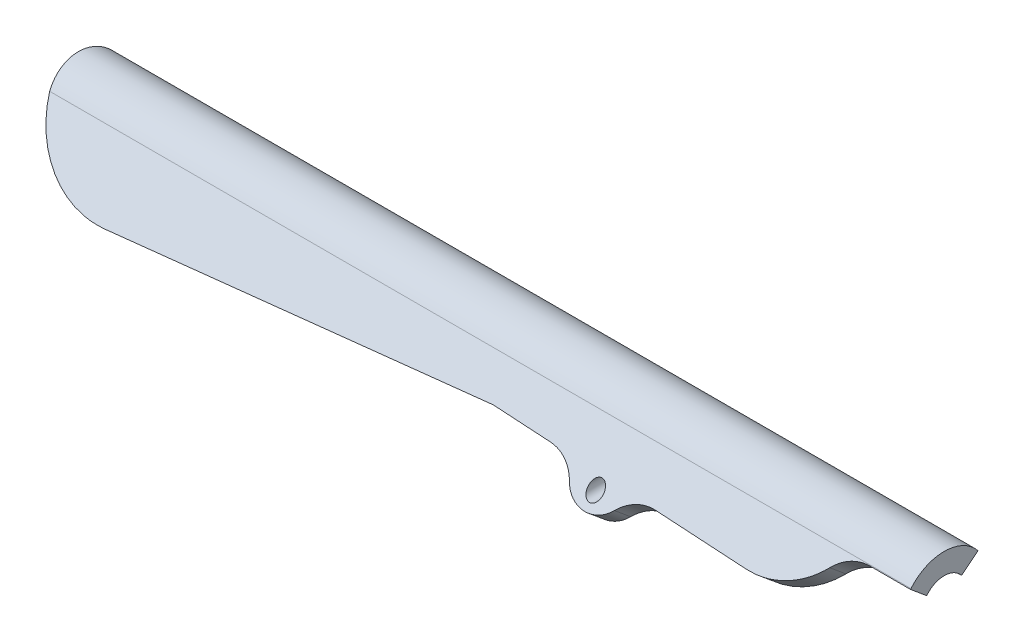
ISO-10303-21;
HEADER;
FILE_DESCRIPTION(('STEP AP214'),'2;1');
FILE_NAME('part.step','',(''),(''),'','','');
FILE_SCHEMA(('AUTOMOTIVE_DESIGN { 1 0 10303 214 1 1 1 1 }'));
ENDSEC;
DATA;
#1=APPLICATION_CONTEXT('core data for automotive mechanical design processes');
#2=APPLICATION_PROTOCOL_DEFINITION('international standard','automotive_design',2000,#1);
#3=PRODUCT_CONTEXT('',#1,'mechanical');
#4=PRODUCT('Part','Part','',(#3));
#5=PRODUCT_RELATED_PRODUCT_CATEGORY('part','',(#4));
#6=PRODUCT_DEFINITION_FORMATION('','',#4);
#7=PRODUCT_DEFINITION_CONTEXT('part definition',#1,'design');
#8=PRODUCT_DEFINITION('design','',#6,#7);
#9=PRODUCT_DEFINITION_SHAPE('','',#8);
#10=(LENGTH_UNIT() NAMED_UNIT(*) SI_UNIT(.MILLI.,.METRE.));
#11=(NAMED_UNIT(*) PLANE_ANGLE_UNIT() SI_UNIT($,.RADIAN.));
#12=(NAMED_UNIT(*) SI_UNIT($,.STERADIAN.) SOLID_ANGLE_UNIT());
#13=UNCERTAINTY_MEASURE_WITH_UNIT(LENGTH_MEASURE(1.E-05),#10,'distance_accuracy_value','');
#14=(GEOMETRIC_REPRESENTATION_CONTEXT(3) GLOBAL_UNCERTAINTY_ASSIGNED_CONTEXT((#13)) GLOBAL_UNIT_ASSIGNED_CONTEXT((#10,
#11,#12)) REPRESENTATION_CONTEXT('',''));
#15=CARTESIAN_POINT('',(0.,0.,0.));
#16=DIRECTION('',(0.,0.,1.));
#17=DIRECTION('',(1.,0.,0.));
#18=AXIS2_PLACEMENT_3D('',#15,#16,#17);
#19=CARTESIAN_POINT('',(49.3250065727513,-1.78264212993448,-3.77447400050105));
#20=DIRECTION('',(0.,-0.576735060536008,0.816931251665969));
#21=DIRECTION('',(0.,-0.816931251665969,-0.576735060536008));
#22=AXIS2_PLACEMENT_3D('',#19,#20,#21);
#23=CYLINDRICAL_SURFACE('',#22,2.54);
#24=CARTESIAN_POINT('',(48.5272938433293,0.187374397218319,-2.38368671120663));
#25=CARTESIAN_POINT('',(48.1530310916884,0.0861521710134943,-2.45514732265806));
#26=CARTESIAN_POINT('',(47.8336700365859,-0.10300208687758,-2.58868596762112));
#27=CARTESIAN_POINT('',(47.5147402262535,-0.291900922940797,-2.72204429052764));
#28=CARTESIAN_POINT('',(47.2804161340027,-0.551472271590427,-2.90529581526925));
#29=B_SPLINE_CURVE_WITH_KNOTS('',2,(#24,#25,#26,#27,#28),.UNSPECIFIED.,.F.,.F.,(3,2,3),(0.,0.5,
1.),.UNSPECIFIED.);
#30=CARTESIAN_POINT('',(48.5272938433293,0.187374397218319,-2.38368671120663));
#31=VERTEX_POINT('',#30);
#32=CARTESIAN_POINT('',(47.2804161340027,-0.551472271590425,-2.90529581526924));
#33=VERTEX_POINT('',#32);
#34=EDGE_CURVE('E666',#31,#33,#29,.T.);
#35=ORIENTED_EDGE('',*,*,#34,.F.);
#36=DIRECTION('',(1.46348999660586E-13,-0.576735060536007,0.81693125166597));
#37=VECTOR('',#36,1.);
#38=CARTESIAN_POINT('',(48.5272938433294,-0.222799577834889,-1.80268520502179));
#39=LINE('',#38,#37);
#40=CARTESIAN_POINT('',(48.5272938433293,-0.632973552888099,-1.22168369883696));
#41=VERTEX_POINT('',#40);
#42=EDGE_CURVE('E13',#31,#41,#39,.T.);
#43=ORIENTED_EDGE('',*,*,#42,.T.);
#44=CARTESIAN_POINT('',(47.2804161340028,-1.37182022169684,-1.74329280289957));
#45=CARTESIAN_POINT('',(47.5144084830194,-1.11261635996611,-1.56030071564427));
#46=CARTESIAN_POINT('',(47.8336700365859,-0.923350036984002,-1.42668295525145));
#47=CARTESIAN_POINT('',(48.1525004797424,-0.734339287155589,-1.2932456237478));
#48=CARTESIAN_POINT('',(48.5272938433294,-0.632973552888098,-1.22168369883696));
#49=B_SPLINE_CURVE_WITH_KNOTS('',2,(#44,#45,#46,#47,#48),.UNSPECIFIED.,.F.,.F.,(3,2,3),(0.,0.5,
1.),.UNSPECIFIED.);
#50=CARTESIAN_POINT('',(47.2804161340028,-1.37182022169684,-1.74329280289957));
#51=VERTEX_POINT('',#50);
#52=EDGE_CURVE('E868',#51,#41,#49,.T.);
#53=ORIENTED_EDGE('',*,*,#52,.F.);
#54=DIRECTION('',(0.,-0.576735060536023,0.816931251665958));
#55=VECTOR('',#54,1.);
#56=CARTESIAN_POINT('',(47.2804161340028,-0.961646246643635,-2.32429430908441));
#57=LINE('',#56,#55);
#58=EDGE_CURVE('E831',#33,#51,#57,.T.);
#59=ORIENTED_EDGE('',*,*,#58,.F.);
#60=EDGE_LOOP('',(#35,#43,#53,#59));
#61=FACE_BOUND('',#60,.T.);
#62=ADVANCED_FACE('F423',(#61),#23,.F.);
#63=CARTESIAN_POINT('',(52.0699999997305,-1.49545472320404,-1.10099961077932E-13));
#64=DIRECTION('',(-1.,0.,0.));
#65=DIRECTION('',(0.,0.,-1.));
#66=AXIS2_PLACEMENT_3D('',#63,#64,#65);
#67=CYLINDRICAL_SURFACE('',#66,2.91785472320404);
#68=CARTESIAN_POINT('',(48.5272938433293,0.187374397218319,-2.38368671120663));
#69=CARTESIAN_POINT('',(48.5601779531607,0.199103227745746,-2.37536072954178));
#70=CARTESIAN_POINT('',(48.593436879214,0.210085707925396,-2.36746300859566));
#71=CARTESIAN_POINT('',(48.660181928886,0.230417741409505,-2.35268089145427));
#72=CARTESIAN_POINT('',(48.6936595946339,0.239786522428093,-2.34578474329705));
#73=CARTESIAN_POINT('',(48.7607210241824,0.256938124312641,-2.33303075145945));
#74=CARTESIAN_POINT('',(48.7942973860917,0.264740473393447,-2.32716025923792));
#75=CARTESIAN_POINT('',(48.8614430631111,0.278805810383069,-2.31647851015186));
#76=CARTESIAN_POINT('',(48.8950060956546,0.285088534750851,-2.31165376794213));
#77=CARTESIAN_POINT('',(48.9620196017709,0.29616158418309,-2.30308012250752));
#78=CARTESIAN_POINT('',(48.9954649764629,0.300971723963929,-2.29931699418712));
#79=CARTESIAN_POINT('',(49.0621449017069,0.309146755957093,-2.29287907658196));
#80=CARTESIAN_POINT('',(49.0953755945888,0.312531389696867,-2.29018944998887));
#81=CARTESIAN_POINT('',(49.1615354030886,0.317902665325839,-2.285907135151));
#82=CARTESIAN_POINT('',(49.1944619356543,0.319908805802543,-2.28429915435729));
#83=CARTESIAN_POINT('',(49.2599280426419,0.322570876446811,-2.28218461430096));
#84=CARTESIAN_POINT('',(49.2924663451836,0.32324587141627,-2.28166249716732));
#85=CARTESIAN_POINT('',(49.3250065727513,0.323269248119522,-2.28169220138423));
#86=B_SPLINE_CURVE_WITH_KNOTS('',3,(#68,#69,#70,#71,#72,#73,#74,#75,#76,#77,#78,#79,#80,#81,#82,
#83,#84,#85),.UNSPECIFIED.,.F.,.F.,(4,2,2,2,2,2,2,2,4),(0.,0.107664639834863,0.213941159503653,
0.318796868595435,0.422207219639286,0.524157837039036,0.62464602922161,0.723681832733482,
0.82128862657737),.UNSPECIFIED.);
#87=CARTESIAN_POINT('',(49.3250065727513,0.323269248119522,-2.28169220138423));
#88=VERTEX_POINT('',#87);
#89=EDGE_CURVE('E433',#88,#31,#86,.F.);
#90=ORIENTED_EDGE('',*,*,#89,.T.);
#91=DIRECTION('',(-1.,0.,0.));
#92=VECTOR('',#91,1.);
#93=CARTESIAN_POINT('',(21.2690017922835,0.187374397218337,-2.38368671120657));
#94=LINE('',#93,#92);
#95=CARTESIAN_POINT('',(-5.98929025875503,0.18737439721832,-2.38368671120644));
#96=VERTEX_POINT('',#95);
#97=EDGE_CURVE('E442',#31,#96,#94,.T.);
#98=ORIENTED_EDGE('',*,*,#97,.T.);
#99=CARTESIAN_POINT('',(-6.04825674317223,0.371461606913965,2.24243162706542));
#100=CARTESIAN_POINT('',(-6.15314179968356,0.70475845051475,1.96494331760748));
#101=CARTESIAN_POINT('',(-6.30774706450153,1.25662047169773,1.25149744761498));
#102=CARTESIAN_POINT('',(-6.3777155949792,1.53024276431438,-0.128031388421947));
#103=CARTESIAN_POINT('',(-6.27720422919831,1.14087410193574,-1.47680446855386));
#104=CARTESIAN_POINT('',(-6.10427265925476,0.539985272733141,-2.1347560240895));
#105=CARTESIAN_POINT('',(-5.98929025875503,0.187374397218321,-2.38368671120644));
#106=B_SPLINE_CURVE_WITH_KNOTS('',3,(#99,#100,#101,#102,#103,#104,#105),.UNSPECIFIED.,.F.,.F.,
(4,1,1,1,4),(0.,0.250086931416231,0.499805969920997,0.749640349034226,1.),.UNSPECIFIED.);
#107=CARTESIAN_POINT('',(-6.04825674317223,0.371461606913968,2.24243162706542));
#108=VERTEX_POINT('',#107);
#109=EDGE_CURVE('E715',#96,#108,#106,.F.);
#110=ORIENTED_EDGE('',*,*,#109,.T.);
#111=DIRECTION('',(-1.,0.,0.));
#112=VECTOR('',#111,1.);
#113=CARTESIAN_POINT('',(23.0108716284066,0.371461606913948,2.24243162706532));
#114=LINE('',#113,#112);
#115=CARTESIAN_POINT('',(52.07,0.371461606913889,2.24243162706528));
#116=VERTEX_POINT('',#115);
#117=EDGE_CURVE('E812',#116,#108,#114,.T.);
#118=ORIENTED_EDGE('',*,*,#117,.F.);
#119=CARTESIAN_POINT('',(52.07,-1.49545472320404,-1.10099961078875E-13));
#120=DIRECTION('',(-1.,0.,0.));
#121=DIRECTION('',(0.,0.63982497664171,0.768520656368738));
#122=AXIS2_PLACEMENT_3D('',#119,#120,#121);
#123=CIRCLE('',#122,2.91785472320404);
#124=CARTESIAN_POINT('',(52.07,0.323269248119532,-2.28169220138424));
#125=VERTEX_POINT('',#124);
#126=EDGE_CURVE('E1602',#116,#125,#123,.T.);
#127=ORIENTED_EDGE('',*,*,#126,.T.);
#128=DIRECTION('',(-1.,0.,0.));
#129=VECTOR('',#128,1.);
#130=CARTESIAN_POINT('',(50.6975032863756,0.323269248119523,-2.28169220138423));
#131=LINE('',#130,#129);
#132=EDGE_CURVE('E1609',#125,#88,#131,.T.);
#133=ORIENTED_EDGE('',*,*,#132,.T.);
#134=EDGE_LOOP('',(#90,#98,#110,#118,#127,#133));
#135=FACE_BOUND('',#134,.T.);
#136=ADVANCED_FACE('F681',(#135),#67,.T.);
#137=CARTESIAN_POINT('',(0.,1.91086744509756,-1.16693944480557));
#138=DIRECTION('',(0.,-0.576735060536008,0.816931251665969));
#139=DIRECTION('',(0.,-0.816931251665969,-0.576735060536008));
#140=AXIS2_PLACEMENT_3D('',#137,#138,#139);
#141=CYLINDRICAL_SURFACE('',#140,6.35);
#142=CARTESIAN_POINT('',(0.,1.09051949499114,-0.00493643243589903));
#143=DIRECTION('',(0.,0.576735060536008,-0.816931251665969));
#144=DIRECTION('',(0.,-0.816931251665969,-0.576735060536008));
#145=AXIS2_PLACEMENT_3D('',#142,#143,#144);
#146=CIRCLE('',#145,6.35);
#147=CARTESIAN_POINT('',(0.,-4.09699395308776,-3.66720406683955));
#148=VERTEX_POINT('',#147);
#149=CARTESIAN_POINT('',(-5.98929025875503,-0.632973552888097,-1.22168369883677));
#150=VERTEX_POINT('',#149);
#151=EDGE_CURVE('E839',#148,#150,#146,.T.);
#152=ORIENTED_EDGE('',*,*,#151,.T.);
#153=DIRECTION('',(0.,0.576735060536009,-0.816931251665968));
#154=VECTOR('',#153,1.);
#155=CARTESIAN_POINT('',(-5.98929025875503,-0.222799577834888,-1.8026852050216));
#156=LINE('',#155,#154);
#157=EDGE_CURVE('E720',#150,#96,#156,.T.);
#158=ORIENTED_EDGE('',*,*,#157,.T.);
#159=CARTESIAN_POINT('',(0.,-3.27664600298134,-4.82920707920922));
#160=CARTESIAN_POINT('',(-0.489887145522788,-3.27657916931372,-4.82915989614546));
#161=CARTESIAN_POINT('',(-0.974126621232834,-3.21520435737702,-4.78583066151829));
#162=CARTESIAN_POINT('',(-1.45740731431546,-3.15395106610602,-4.74258721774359));
#163=CARTESIAN_POINT('',(-1.92518494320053,-3.03242353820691,-4.65679152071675));
#164=CARTESIAN_POINT('',(-2.39168825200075,-2.91122707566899,-4.57122954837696));
#165=CARTESIAN_POINT('',(-2.83068573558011,-2.73267037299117,-4.44517253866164));
#166=CARTESIAN_POINT('',(-3.26890534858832,-2.55443005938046,-4.31933889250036));
#167=CARTESIAN_POINT('',(-3.66917321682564,-2.32296979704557,-4.15593316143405));
#168=CARTESIAN_POINT('',(-4.06854806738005,-2.09202593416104,-3.99289199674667));
#169=CARTESIAN_POINT('',(-4.42077476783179,-1.81301201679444,-3.79591445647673));
#170=CARTESIAN_POINT('',(-4.77205510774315,-1.53474775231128,-3.59946615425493));
#171=CARTESIAN_POINT('',(-5.06769996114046,-1.21488996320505,-3.37365376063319));
#172=CARTESIAN_POINT('',(-5.36283273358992,-0.895586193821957,-3.1482324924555));
#173=CARTESIAN_POINT('',(-5.59470963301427,-0.54280193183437,-2.89917475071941));
#174=CARTESIAN_POINT('',(-5.82627045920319,-0.190498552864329,-2.65045650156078));
#175=CARTESIAN_POINT('',(-5.98929025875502,0.18737439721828,-2.38368671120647));
#176=B_SPLINE_CURVE_WITH_KNOTS('',2,(#159,#160,#161,#162,#163,#164,#165,#166,#167,#168,#169,
#170,#171,#172,#173,#174,#175),.UNSPECIFIED.,.F.,.F.,(3,2,2,2,2,2,2,2,3),(0.,0.125,0.25,0.375,
0.5,0.625,0.75,0.875,1.),.UNSPECIFIED.);
#177=CARTESIAN_POINT('',(0.,-3.27664600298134,-4.82920707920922));
#178=VERTEX_POINT('',#177);
#179=EDGE_CURVE('E956',#178,#96,#176,.T.);
#180=ORIENTED_EDGE('',*,*,#179,.F.);
#181=CARTESIAN_POINT('',(0.511278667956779,-3.25980365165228,-4.81731675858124));
#182=CARTESIAN_POINT('',(0.256054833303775,-3.27664258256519,-4.82920466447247));
#183=CARTESIAN_POINT('',(0.,-3.27664600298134,-4.82920707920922));
#184=B_SPLINE_CURVE_WITH_KNOTS('',2,(#181,#182,#183),.UNSPECIFIED.,.F.,.F.,(3,3),(0.,1.),.UNSPECIFIED.);
#185=CARTESIAN_POINT('',(0.511278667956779,-3.25980365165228,-4.81731675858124));
#186=VERTEX_POINT('',#185);
#187=EDGE_CURVE('E670',#186,#178,#184,.T.);
#188=ORIENTED_EDGE('',*,*,#187,.F.);
#189=DIRECTION('',(0.,-0.576735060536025,0.816931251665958));
#190=VECTOR('',#189,1.);
#191=CARTESIAN_POINT('',(0.511278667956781,-3.6699776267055,-4.23631525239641));
#192=LINE('',#191,#190);
#193=CARTESIAN_POINT('',(0.511278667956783,-4.0801516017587,-3.65531374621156));
#194=VERTEX_POINT('',#193);
#195=EDGE_CURVE('E641',#186,#194,#192,.T.);
#196=ORIENTED_EDGE('',*,*,#195,.T.);
#197=CARTESIAN_POINT('',(0.511278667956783,-4.0801516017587,-3.65531374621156));
#198=CARTESIAN_POINT('',(0.25605483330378,-4.09699053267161,-3.6672016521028));
#199=CARTESIAN_POINT('',(0.,-4.09699395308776,-3.66720406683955));
#200=B_SPLINE_CURVE_WITH_KNOTS('',2,(#197,#198,#199),.UNSPECIFIED.,.F.,.F.,(3,3),(0.,1.),.UNSPECIFIED.);
#201=EDGE_CURVE('E639',#194,#148,#200,.T.);
#202=ORIENTED_EDGE('',*,*,#201,.T.);
#203=EDGE_LOOP('',(#152,#158,#180,#188,#196,#202));
#204=FACE_BOUND('',#203,.T.);
#205=ADVANCED_FACE('F691',(#204),#141,.T.);
#206=CARTESIAN_POINT('',(0.,1.09051949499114,-0.00493643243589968));
#207=DIRECTION('',(0.,0.576735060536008,-0.816931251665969));
#208=DIRECTION('',(0.,0.816931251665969,0.576735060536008));
#209=AXIS2_PLACEMENT_3D('',#206,#207,#208);
#210=PLANE('',#209);
#211=CARTESIAN_POINT('',(33.02,-2.29439882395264,-2.39461251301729));
#212=DIRECTION('',(0.,0.576735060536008,-0.816931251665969));
#213=DIRECTION('',(0.,0.816931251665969,0.576735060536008));
#214=AXIS2_PLACEMENT_3D('',#211,#212,#213);
#215=ELLIPSE('',#214,0.62183935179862,0.508000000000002);
#216=CARTESIAN_POINT('',(33.02,-1.78639882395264,-2.03597595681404));
#217=VERTEX_POINT('',#216);
#218=EDGE_CURVE('E1309',#217,#217,#215,.T.);
#219=ORIENTED_EDGE('',*,*,#218,.T.);
#220=EDGE_LOOP('',(#219));
#221=FACE_BOUND('',#220,.T.);
#222=ORIENTED_EDGE('',*,*,#52,.T.);
#223=DIRECTION('',(-1.,0.,0.));
#224=VECTOR('',#223,1.);
#225=CARTESIAN_POINT('',(21.2690017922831,-0.632973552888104,-1.22168369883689));
#226=LINE('',#225,#224);
#227=EDGE_CURVE('E863',#41,#150,#226,.T.);
#228=ORIENTED_EDGE('',*,*,#227,.T.);
#229=ORIENTED_EDGE('',*,*,#151,.F.);
#230=ORIENTED_EDGE('',*,*,#201,.F.);
#231=DIRECTION('',(-0.996753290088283,-0.0657763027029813,-0.0464365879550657));
#232=VECTOR('',#231,1.);
#233=CARTESIAN_POINT('',(12.9612569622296,-3.25857062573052,-3.07529608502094));
#234=LINE('',#233,#232);
#235=CARTESIAN_POINT('',(25.4112352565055,-2.43698964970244,-2.49527842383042));
#236=VERTEX_POINT('',#235);
#237=EDGE_CURVE('E661',#236,#194,#234,.T.);
#238=ORIENTED_EDGE('',*,*,#237,.F.);
#239=DIRECTION('',(-0.999071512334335,0.0351955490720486,0.0248472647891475));
#240=VECTOR('',#239,1.);
#241=CARTESIAN_POINT('',(27.3934124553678,-2.50681829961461,-2.54457587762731));
#242=LINE('',#241,#240);
#243=CARTESIAN_POINT('',(29.3755896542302,-2.5766469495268,-2.59387333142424));
#244=VERTEX_POINT('',#243);
#245=EDGE_CURVE('E663',#244,#236,#242,.T.);
#246=ORIENTED_EDGE('',*,*,#245,.F.);
#247=CARTESIAN_POINT('',(29.3755896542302,-2.5766469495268,-2.59387333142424));
#248=CARTESIAN_POINT('',(29.6822656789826,-2.58752923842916,-2.60155598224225));
#249=CARTESIAN_POINT('',(29.9772074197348,-2.65770659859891,-2.65109961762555));
#250=CARTESIAN_POINT('',(30.2714900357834,-2.72772712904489,-2.7005325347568));
#251=CARTESIAN_POINT('',(30.5378509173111,-2.85353170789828,-2.78934773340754));
#252=CARTESIAN_POINT('',(30.8032227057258,-2.97886912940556,-2.87783312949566));
#253=CARTESIAN_POINT('',(31.0252062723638,-3.15287836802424,-3.00067973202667));
#254=CARTESIAN_POINT('',(31.246331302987,-3.32621461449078,-3.12305121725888));
#255=CARTESIAN_POINT('',(31.4112113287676,-3.53847283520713,-3.27290073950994));
#256=B_SPLINE_CURVE_WITH_KNOTS('',2,(#247,#248,#249,#250,#251,#252,#253,#254,#255),
.UNSPECIFIED.,.F.,.F.,(3,2,2,2,3),(0.,0.25,0.5,0.75,1.),.UNSPECIFIED.);
#257=CARTESIAN_POINT('',(31.4112113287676,-3.53847283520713,-3.27290073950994));
#258=VERTEX_POINT('',#257);
#259=EDGE_CURVE('E869',#244,#258,#256,.T.);
#260=ORIENTED_EDGE('',*,*,#259,.T.);
#261=CARTESIAN_POINT('',(33.02,-2.70503317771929,-2.68451111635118));
#262=DIRECTION('',(0.,0.576735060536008,-0.816931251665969));
#263=DIRECTION('',(0.,-0.816931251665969,-0.576735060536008));
#264=AXIS2_PLACEMENT_3D('',#261,#262,#263);
#265=CIRCLE('',#264,1.90500000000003);
#266=CARTESIAN_POINT('',(33.02,-4.26128721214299,-3.7831914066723));
#267=VERTEX_POINT('',#266);
#268=EDGE_CURVE('E1471',#267,#258,#265,.T.);
#269=ORIENTED_EDGE('',*,*,#268,.F.);
#270=CARTESIAN_POINT('',(33.02,-2.70503317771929,-2.68451111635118));
#271=DIRECTION('',(0.,0.576735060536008,-0.816931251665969));
#272=DIRECTION('',(0.795271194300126,-0.495267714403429,-0.349647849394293));
#273=AXIS2_PLACEMENT_3D('',#270,#271,#272);
#274=CIRCLE('',#273,1.90500000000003);
#275=CARTESIAN_POINT('',(34.5349916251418,-3.64851817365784,-3.35059026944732));
#276=VERTEX_POINT('',#275);
#277=EDGE_CURVE('E1051',#276,#267,#274,.T.);
#278=ORIENTED_EDGE('',*,*,#277,.F.);
#279=CARTESIAN_POINT('',(34.5349916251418,-3.64851817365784,-3.35059026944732));
#280=CARTESIAN_POINT('',(34.7211669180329,-3.44913607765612,-3.20983100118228));
#281=CARTESIAN_POINT('',(34.9602020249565,-3.2915037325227,-3.09854611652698));
#282=CARTESIAN_POINT('',(35.1987029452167,-3.1342236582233,-2.98750992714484));
#283=CARTESIAN_POINT('',(35.4772866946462,-3.02753936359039,-2.91219321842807));
#284=CARTESIAN_POINT('',(35.7548359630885,-2.92125122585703,-2.83715618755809));
#285=CARTESIAN_POINT('',(36.0564854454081,-2.8718637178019,-2.80228971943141));
#286=CARTESIAN_POINT('',(36.3569682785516,-2.82266721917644,-2.76755809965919));
#287=CARTESIAN_POINT('',(36.6644103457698,-2.83341940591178,-2.77514890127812));
#288=B_SPLINE_CURVE_WITH_KNOTS('',2,(#279,#280,#281,#282,#283,#284,#285,#286,#287),
.UNSPECIFIED.,.F.,.F.,(3,2,2,2,3),(0.,0.25,0.5,0.75,1.),.UNSPECIFIED.);
#289=CARTESIAN_POINT('',(36.6644103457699,-2.83341940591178,-2.77514890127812));
#290=VERTEX_POINT('',#289);
#291=EDGE_CURVE('E810',#276,#290,#288,.T.);
#292=ORIENTED_EDGE('',*,*,#291,.T.);
#293=DIRECTION('',(-0.999071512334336,0.0351955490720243,0.0248472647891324));
#294=VECTOR('',#293,1.);
#295=CARTESIAN_POINT('',(39.818392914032,-2.94452871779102,-2.85358957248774));
#296=LINE('',#295,#294);
#297=CARTESIAN_POINT('',(42.972375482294,-3.05563802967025,-2.93203024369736));
#298=VERTEX_POINT('',#297);
#299=EDGE_CURVE('E1505',#298,#290,#296,.T.);
#300=ORIENTED_EDGE('',*,*,#299,.F.);
#301=CARTESIAN_POINT('',(43.1912352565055,-3.05949126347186,-2.93475053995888));
#302=CARTESIAN_POINT('',(43.0817545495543,-3.05949103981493,-2.93475038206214));
#303=CARTESIAN_POINT('',(42.972375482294,-3.05563802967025,-2.93203024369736));
#304=B_SPLINE_CURVE_WITH_KNOTS('',2,(#301,#302,#303),.UNSPECIFIED.,.F.,.F.,(3,3),(0.,1.),.UNSPECIFIED.);
#305=CARTESIAN_POINT('',(43.1912352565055,-3.05949126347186,-2.93475053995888));
#306=VERTEX_POINT('',#305);
#307=EDGE_CURVE('E1472',#306,#298,#304,.T.);
#308=ORIENTED_EDGE('',*,*,#307,.F.);
#309=CARTESIAN_POINT('',(43.1912352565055,1.09051949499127,-0.00493643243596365));
#310=DIRECTION('',(0.,0.576735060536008,-0.816931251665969));
#311=DIRECTION('',(0.804956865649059,-0.484712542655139,-0.342196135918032));
#312=AXIS2_PLACEMENT_3D('',#309,#310,#311);
#313=CIRCLE('',#312,5.08);
#314=EDGE_CURVE('E896',#51,#306,#313,.T.);
#315=ORIENTED_EDGE('',*,*,#314,.F.);
#316=EDGE_LOOP('',(#222,#228,#229,#230,#238,#246,#260,#269,#278,#292,#300,#308,#315));
#317=FACE_BOUND('',#316,.T.);
#318=ADVANCED_FACE('F778',(#221,#317),#210,.F.);
#319=CARTESIAN_POINT('',(52.0699999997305,-1.49545472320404,-1.10099961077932E-13));
#320=DIRECTION('',(-1.,0.,0.));
#321=DIRECTION('',(0.,0.,-1.));
#322=AXIS2_PLACEMENT_3D('',#319,#320,#321);
#323=CYLINDRICAL_SURFACE('',#322,1.49545472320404);
#324=ORIENTED_EDGE('',*,*,#227,.F.);
#325=CARTESIAN_POINT('',(49.3250065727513,-0.563324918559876,-1.16940961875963));
#326=CARTESIAN_POINT('',(49.0570164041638,-0.563325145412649,-1.16940979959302));
#327=CARTESIAN_POINT('',(48.7887933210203,-0.585081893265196,-1.18787330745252));
#328=CARTESIAN_POINT('',(48.5272938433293,-0.632973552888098,-1.22168369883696));
#329=B_SPLINE_CURVE_WITH_KNOTS('',3,(#325,#326,#327,#328),.UNSPECIFIED.,.F.,.F.,(4,4),(0.,1.),.UNSPECIFIED.);
#330=CARTESIAN_POINT('',(49.3250065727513,-0.563324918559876,-1.16940961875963));
#331=VERTEX_POINT('',#330);
#332=EDGE_CURVE('E805',#41,#331,#329,.F.);
#333=ORIENTED_EDGE('',*,*,#332,.T.);
#334=DIRECTION('',(-1.,0.,0.));
#335=VECTOR('',#334,1.);
#336=CARTESIAN_POINT('',(50.6975032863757,-0.563324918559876,-1.16940961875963));
#337=LINE('',#336,#335);
#338=CARTESIAN_POINT('',(52.07,-0.563324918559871,-1.16940961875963));
#339=VERTEX_POINT('',#338);
#340=EDGE_CURVE('E801',#339,#331,#337,.T.);
#341=ORIENTED_EDGE('',*,*,#340,.F.);
#342=CARTESIAN_POINT('',(52.07,-0.538625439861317,1.14928784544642));
#343=CARTESIAN_POINT('',(52.07,-0.410577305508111,1.04255514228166));
#344=CARTESIAN_POINT('',(52.07,-0.309252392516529,0.910644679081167));
#345=CARTESIAN_POINT('',(52.07,-0.20809594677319,0.77895353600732));
#346=CARTESIAN_POINT('',(52.07,-0.137986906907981,0.627395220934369));
#347=CARTESIAN_POINT('',(52.07,-0.0682990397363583,0.476747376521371));
#348=CARTESIAN_POINT('',(52.07,-0.0332247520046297,0.313410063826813));
#349=CARTESIAN_POINT('',(52.07,0.0016136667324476,0.151171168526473));
#350=CARTESIAN_POINT('',(52.07,-9.69403661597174E-05,-0.015928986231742));
#351=CARTESIAN_POINT('',(52.07,-0.00179612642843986,-0.181913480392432));
#352=CARTESIAN_POINT('',(52.07,-0.0402427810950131,-0.344482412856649));
#353=CARTESIAN_POINT('',(52.07,-0.0783860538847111,-0.505768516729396));
#354=CARTESIAN_POINT('',(52.07,-0.151700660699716,-0.656153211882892));
#355=CARTESIAN_POINT('',(52.07,-0.22440434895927,-0.805284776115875));
#356=CARTESIAN_POINT('',(52.07,-0.328920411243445,-0.935706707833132));
#357=CARTESIAN_POINT('',(52.07,-0.43259797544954,-1.06508230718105));
#358=CARTESIAN_POINT('',(52.07,-0.563324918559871,-1.16940961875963));
#359=B_SPLINE_CURVE_WITH_KNOTS('',2,(#342,#343,#344,#345,#346,#347,#348,#349,#350,#351,#352,
#353,#354,#355,#356,#357,#358),.UNSPECIFIED.,.F.,.F.,(3,2,2,2,2,2,2,2,3),(0.,0.125,0.25,0.375,
0.5,0.625,0.75,0.875,1.),.UNSPECIFIED.);
#360=CARTESIAN_POINT('',(52.07,-0.538625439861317,1.14928784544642));
#361=VERTEX_POINT('',#360);
#362=EDGE_CURVE('E1368',#361,#339,#359,.T.);
#363=ORIENTED_EDGE('',*,*,#362,.F.);
#364=DIRECTION('',(-1.,0.,0.));
#365=VECTOR('',#364,1.);
#366=CARTESIAN_POINT('',(23.0108716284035,-0.538625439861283,1.14928784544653));
#367=LINE('',#366,#365);
#368=CARTESIAN_POINT('',(-6.04825674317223,-0.538625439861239,1.14928784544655));
#369=VERTEX_POINT('',#368);
#370=EDGE_CURVE('E804',#361,#369,#367,.T.);
#371=ORIENTED_EDGE('',*,*,#370,.T.);
#372=CARTESIAN_POINT('',(-5.98929025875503,-0.632973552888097,-1.22168369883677));
#373=CARTESIAN_POINT('',(-6.09765972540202,-0.462647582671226,-1.10143964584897));
#374=CARTESIAN_POINT('',(-6.28041762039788,-0.139227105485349,-0.753740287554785));
#375=CARTESIAN_POINT('',(-6.3763109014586,0.0530302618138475,-0.0657315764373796));
#376=CARTESIAN_POINT('',(-6.31015838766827,-0.081051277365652,0.638725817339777));
#377=CARTESIAN_POINT('',(-6.14842287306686,-0.375490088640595,1.01346851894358));
#378=CARTESIAN_POINT('',(-6.04825674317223,-0.53862543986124,1.14928784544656));
#379=B_SPLINE_CURVE_WITH_KNOTS('',3,(#372,#373,#374,#375,#376,#377,#378),.UNSPECIFIED.,.F.,.F.,
(4,1,1,1,4),(0.,0.250359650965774,0.500194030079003,0.749913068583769,1.),.UNSPECIFIED.);
#380=EDGE_CURVE('E762',#150,#369,#379,.T.);
#381=ORIENTED_EDGE('',*,*,#380,.F.);
#382=EDGE_LOOP('',(#324,#333,#341,#363,#371,#381));
#383=FACE_BOUND('',#382,.T.);
#384=ADVANCED_FACE('F769',(#383),#323,.F.);
#385=CARTESIAN_POINT('',(0.,1.85792645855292,1.00488865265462));
#386=DIRECTION('',(0.,0.639824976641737,0.768520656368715));
#387=DIRECTION('',(0.,-0.768520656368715,0.639824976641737));
#388=AXIS2_PLACEMENT_3D('',#385,#386,#387);
#389=PLANE('',#388);
#390=CARTESIAN_POINT('',(33.02,-2.29439882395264,4.4618698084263));
#391=DIRECTION('',(0.,0.639824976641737,0.768520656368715));
#392=DIRECTION('',(0.,-0.768520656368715,0.639824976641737));
#393=AXIS2_PLACEMENT_3D('',#390,#391,#392);
#394=ELLIPSE('',#393,0.661010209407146,0.508000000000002);
#395=CARTESIAN_POINT('',(33.02,-2.80239882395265,4.88480065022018));
#396=VERTEX_POINT('',#395);
#397=EDGE_CURVE('E1311',#396,#396,#394,.T.);
#398=ORIENTED_EDGE('',*,*,#397,.F.);
#399=EDGE_LOOP('',(#398));
#400=FACE_BOUND('',#399,.T.);
#401=DIRECTION('',(0.,0.768520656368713,-0.639824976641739));
#402=VECTOR('',#401,1.);
#403=CARTESIAN_POINT('',(52.07,0.353397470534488,2.25747076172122));
#404=LINE('',#403,#402);
#405=CARTESIAN_POINT('',(52.07,0.335333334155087,2.27250989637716));
#406=VERTEX_POINT('',#405);
#407=EDGE_CURVE('E806',#406,#116,#404,.T.);
#408=ORIENTED_EDGE('',*,*,#407,.T.);
#409=ORIENTED_EDGE('',*,*,#117,.T.);
#410=CARTESIAN_POINT('',(-6.04825674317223,0.371461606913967,2.24243162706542));
#411=CARTESIAN_POINT('',(-5.89540895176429,0.00435193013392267,2.54806549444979));
#412=CARTESIAN_POINT('',(-5.66951840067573,-0.339891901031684,2.83466260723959));
#413=CARTESIAN_POINT('',(-5.4440707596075,-0.683460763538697,3.12069778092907));
#414=CARTESIAN_POINT('',(-5.15016601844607,-0.996728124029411,3.38150571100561));
#415=CARTESIAN_POINT('',(-4.85712098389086,-1.30907913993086,3.64155074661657));
#416=CARTESIAN_POINT('',(-4.50311703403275,-1.58278089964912,3.86941869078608));
#417=CARTESIAN_POINT('',(-4.14979227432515,-1.85595753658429,4.09684944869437));
#418=CARTESIAN_POINT('',(-3.7443519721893,-2.083487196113,4.28627722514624));
#419=CARTESIAN_POINT('',(-3.33965305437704,-2.31060079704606,4.47535861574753));
#420=CARTESIAN_POINT('',(-2.89267957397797,-2.48639969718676,4.62171841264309));
#421=CARTESIAN_POINT('',(-2.4465303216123,-2.66187442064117,4.76780831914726));
#422=CARTESIAN_POINT('',(-1.96926233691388,-2.78156437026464,4.86745511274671));
#423=CARTESIAN_POINT('',(-1.49289099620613,-2.9010294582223,4.96691469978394));
#424=CARTESIAN_POINT('',(-0.996996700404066,-2.96162991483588,5.01736706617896));
#425=CARTESIAN_POINT('',(-0.502044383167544,-3.02211525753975,5.06772359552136));
#426=CARTESIAN_POINT('',(1.03914423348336E-13,-3.02217970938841,5.06777725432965));
#427=B_SPLINE_CURVE_WITH_KNOTS('',2,(#410,#411,#412,#413,#414,#415,#416,#417,#418,#419,#420,
#421,#422,#423,#424,#425,#426),.UNSPECIFIED.,.F.,.F.,(3,2,2,2,2,2,2,2,3),(0.,0.125,0.25,0.375,
0.5,0.625,0.75,0.875,1.),.UNSPECIFIED.);
#428=CARTESIAN_POINT('',(0.,-3.02217970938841,5.06777725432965));
#429=VERTEX_POINT('',#428);
#430=EDGE_CURVE('E819',#108,#429,#427,.T.);
#431=ORIENTED_EDGE('',*,*,#430,.T.);
#432=CARTESIAN_POINT('',(0.,-3.02217970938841,5.06777725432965));
#433=CARTESIAN_POINT('',(0.256054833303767,-3.02217649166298,5.06777457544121));
#434=CARTESIAN_POINT('',(0.51127866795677,-3.00633542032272,5.05458623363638));
#435=B_SPLINE_CURVE_WITH_KNOTS('',2,(#432,#433,#434),.UNSPECIFIED.,.F.,.F.,(3,3),(0.,1.),.UNSPECIFIED.);
#436=CARTESIAN_POINT('',(0.51127866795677,-3.00633542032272,5.05458623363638));
#437=VERTEX_POINT('',#436);
#438=EDGE_CURVE('E1320',#429,#437,#435,.T.);
#439=ORIENTED_EDGE('',*,*,#438,.T.);
#440=DIRECTION('',(0.996753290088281,0.0618784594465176,-0.0515163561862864));
#441=VECTOR('',#440,1.);
#442=CARTESIAN_POINT('',(12.9612569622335,-2.23344057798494,4.41111956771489));
#443=LINE('',#442,#441);
#444=CARTESIAN_POINT('',(25.4112352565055,-1.46054573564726,3.76765290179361));
#445=VERTEX_POINT('',#444);
#446=EDGE_CURVE('E1319',#437,#445,#443,.T.);
#447=ORIENTED_EDGE('',*,*,#446,.T.);
#448=DIRECTION('',(0.999071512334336,-0.0331098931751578,0.0275653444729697));
#449=VECTOR('',#448,1.);
#450=CARTESIAN_POINT('',(27.393412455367,-1.52623640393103,3.82234307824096));
#451=LINE('',#450,#449);
#452=CARTESIAN_POINT('',(29.3755896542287,-1.59192707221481,3.87703325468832));
#453=VERTEX_POINT('',#452);
#454=EDGE_CURVE('E616',#445,#453,#451,.T.);
#455=ORIENTED_EDGE('',*,*,#454,.T.);
#456=CARTESIAN_POINT('',(29.3755896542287,-1.59192707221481,3.87703325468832));
#457=CARTESIAN_POINT('',(29.6824715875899,-1.60217102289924,3.88556176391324));
#458=CARTESIAN_POINT('',(29.9772066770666,-1.66817823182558,3.9405154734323));
#459=CARTESIAN_POINT('',(30.2715225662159,-1.73409155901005,3.99539102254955));
#460=CARTESIAN_POINT('',(30.5378507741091,-1.85240383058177,4.0938908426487));
#461=CARTESIAN_POINT('',(30.8032804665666,-1.97031695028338,4.19205835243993));
#462=CARTESIAN_POINT('',(31.0252002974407,-2.13401352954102,4.32834247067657));
#463=CARTESIAN_POINT('',(31.2464402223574,-2.29720858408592,4.46420904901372));
#464=CARTESIAN_POINT('',(31.4112113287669,-2.49675603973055,4.63034049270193));
#465=B_SPLINE_CURVE_WITH_KNOTS('',2,(#456,#457,#458,#459,#460,#461,#462,#463,#464),
.UNSPECIFIED.,.F.,.F.,(3,2,2,2,3),(0.,0.25,0.5,0.75,1.),.UNSPECIFIED.);
#466=CARTESIAN_POINT('',(31.4112113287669,-2.49675603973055,4.63034049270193));
#467=VERTEX_POINT('',#466);
#468=EDGE_CURVE('E1323',#453,#467,#465,.T.);
#469=ORIENTED_EDGE('',*,*,#468,.T.);
#470=CARTESIAN_POINT('',(31.4112113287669,-2.49675603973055,4.63034049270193));
#471=CARTESIAN_POINT('',(31.5346565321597,-2.64625324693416,4.75480305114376));
#472=CARTESIAN_POINT('',(31.7007197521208,-2.76880873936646,4.85683552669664));
#473=CARTESIAN_POINT('',(31.866576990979,-2.89121221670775,4.95874144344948));
#474=CARTESIAN_POINT('',(32.0662414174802,-2.9800084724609,5.03266796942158));
#475=CARTESIAN_POINT('',(32.2652411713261,-3.06850913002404,5.10634839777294));
#476=CARTESIAN_POINT('',(32.4867116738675,-3.11819824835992,5.14771662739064));
#477=CARTESIAN_POINT('',(32.707059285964,-3.16763543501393,5.18887511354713));
#478=CARTESIAN_POINT('',(32.9379291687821,-3.17535233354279,5.19529974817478));
#479=CARTESIAN_POINT('',(33.1673204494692,-3.18301980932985,5.20168323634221));
#480=CARTESIAN_POINT('',(33.3938697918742,-3.14824082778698,5.17272830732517));
#481=CARTESIAN_POINT('',(33.6190423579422,-3.11367320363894,5.14394934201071));
#482=CARTESIAN_POINT('',(33.8282619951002,-3.03840297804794,5.08128379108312));
#483=CARTESIAN_POINT('',(34.0361948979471,-2.96359567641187,5.01900364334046));
#484=CARTESIAN_POINT('',(34.2160841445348,-2.85216958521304,4.9262368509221));
#485=CARTESIAN_POINT('',(34.3949223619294,-2.74139451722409,4.83401206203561));
#486=CARTESIAN_POINT('',(34.5349916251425,-2.60028019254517,4.71652859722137));
#487=B_SPLINE_CURVE_WITH_KNOTS('',2,(#470,#471,#472,#473,#474,#475,#476,#477,#478,#479,#480,
#481,#482,#483,#484,#485,#486),.UNSPECIFIED.,.F.,.F.,(3,2,2,2,2,2,2,2,3),(0.,0.125,0.25,0.375,
0.5,0.625,0.75,0.875,1.),.UNSPECIFIED.);
#488=CARTESIAN_POINT('',(34.5349916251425,-2.60028019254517,4.71652859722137));
#489=VERTEX_POINT('',#488);
#490=EDGE_CURVE('E1326',#467,#489,#487,.T.);
#491=ORIENTED_EDGE('',*,*,#490,.T.);
#492=CARTESIAN_POINT('',(34.5349916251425,-2.60028019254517,4.71652859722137));
#493=CARTESIAN_POINT('',(34.7128849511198,-2.42105031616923,4.56731237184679));
#494=CARTESIAN_POINT('',(34.9389902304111,-2.27771329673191,4.44797842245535));
#495=CARTESIAN_POINT('',(35.1648291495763,-2.13454513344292,4.32878505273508));
#496=CARTESIAN_POINT('',(35.4279828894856,-2.03436045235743,4.24537719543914));
#497=CARTESIAN_POINT('',(35.6901559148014,-1.93454913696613,4.16228018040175));
#498=CARTESIAN_POINT('',(35.9762599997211,-1.88303037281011,4.11938869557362));
#499=CARTESIAN_POINT('',(36.2611092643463,-1.83173756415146,4.07668532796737));
#500=CARTESIAN_POINT('',(36.5549804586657,-1.83167098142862,4.07662989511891));
#501=B_SPLINE_CURVE_WITH_KNOTS('',2,(#492,#493,#494,#495,#496,#497,#498,#499,#500),
.UNSPECIFIED.,.F.,.F.,(3,2,2,2,3),(0.,0.25,0.5,0.75,1.),.UNSPECIFIED.);
#502=CARTESIAN_POINT('',(36.5549804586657,-1.83167098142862,4.07662989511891));
#503=VERTEX_POINT('',#502);
#504=EDGE_CURVE('E1291',#489,#503,#501,.T.);
#505=ORIENTED_EDGE('',*,*,#504,.T.);
#506=CARTESIAN_POINT('',(36.5549804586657,-1.83167098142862,4.07662989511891));
#507=CARTESIAN_POINT('',(36.6097208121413,-1.83167108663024,4.07662998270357));
#508=CARTESIAN_POINT('',(36.6644103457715,-1.83348342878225,4.07813883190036));
#509=B_SPLINE_CURVE_WITH_KNOTS('',2,(#506,#507,#508),.UNSPECIFIED.,.F.,.F.,(3,3),(0.,1.),.UNSPECIFIED.);
#510=CARTESIAN_POINT('',(36.6644103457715,-1.83348342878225,4.07813883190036));
#511=VERTEX_POINT('',#510);
#512=EDGE_CURVE('E1188',#503,#511,#509,.T.);
#513=ORIENTED_EDGE('',*,*,#512,.T.);
#514=DIRECTION('',(0.999071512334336,-0.0331098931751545,0.0275653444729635));
#515=VECTOR('',#514,1.);
#516=CARTESIAN_POINT('',(39.8183929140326,-1.93800850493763,4.165160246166));
#517=LINE('',#516,#515);
#518=CARTESIAN_POINT('',(42.972375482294,-2.04253358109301,4.25218166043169));
#519=VERTEX_POINT('',#518);
#520=EDGE_CURVE('E1185',#511,#519,#517,.T.);
#521=ORIENTED_EDGE('',*,*,#520,.T.);
#522=CARTESIAN_POINT('',(42.972375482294,-2.04253358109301,4.25218166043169));
#523=CARTESIAN_POINT('',(43.5961463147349,-2.06310851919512,4.26931114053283));
#524=CARTESIAN_POINT('',(44.2083290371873,-1.9670688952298,4.18935421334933));
#525=CARTESIAN_POINT('',(44.8196340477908,-1.87116696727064,4.10951192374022));
#526=CARTESIAN_POINT('',(45.3836698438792,-1.66378096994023,3.93685457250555));
#527=CARTESIAN_POINT('',(45.9468849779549,-1.45669671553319,3.76444843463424));
#528=CARTESIAN_POINT('',(46.4284536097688,-1.15075105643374,3.50973612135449));
#529=CARTESIAN_POINT('',(46.9093141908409,-0.84525522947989,3.25539831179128));
#530=CARTESIAN_POINT('',(47.2804161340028,-0.458497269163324,2.93340644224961));
#531=B_SPLINE_CURVE_WITH_KNOTS('',2,(#522,#523,#524,#525,#526,#527,#528,#529,#530),
.UNSPECIFIED.,.F.,.F.,(3,2,2,2,3),(0.,0.25,0.5,0.75,1.),.UNSPECIFIED.);
#532=CARTESIAN_POINT('',(47.2804161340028,-0.458497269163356,2.93340644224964));
#533=VERTEX_POINT('',#532);
#534=EDGE_CURVE('E1189',#519,#533,#531,.T.);
#535=ORIENTED_EDGE('',*,*,#534,.T.);
#536=CARTESIAN_POINT('',(47.2804161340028,-0.458497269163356,2.93340644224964));
#537=CARTESIAN_POINT('',(47.4575977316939,-0.273873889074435,2.7796999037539));
#538=CARTESIAN_POINT('',(47.6854035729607,-0.125860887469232,2.65647300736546));
#539=CARTESIAN_POINT('',(47.9129425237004,0.0219787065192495,2.53339047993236));
#540=CARTESIAN_POINT('',(48.1796681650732,0.125592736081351,2.44712754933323));
#541=CARTESIAN_POINT('',(48.4454172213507,0.22882739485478,2.36118046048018));
#542=CARTESIAN_POINT('',(48.7363070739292,0.282161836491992,2.31677734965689));
#543=CARTESIAN_POINT('',(49.0259479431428,0.335267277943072,2.27256489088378));
#544=CARTESIAN_POINT('',(49.3250065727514,0.335333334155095,2.27250989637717));
#545=B_SPLINE_CURVE_WITH_KNOTS('',2,(#536,#537,#538,#539,#540,#541,#542,#543,#544),
.UNSPECIFIED.,.F.,.F.,(3,2,2,2,3),(0.,0.25,0.5,0.75,1.),.UNSPECIFIED.);
#546=CARTESIAN_POINT('',(49.3250065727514,0.335333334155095,2.27250989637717));
#547=VERTEX_POINT('',#546);
#548=EDGE_CURVE('E1199',#533,#547,#545,.T.);
#549=ORIENTED_EDGE('',*,*,#548,.T.);
#550=DIRECTION('',(1.,0.,0.));
#551=VECTOR('',#550,1.);
#552=CARTESIAN_POINT('',(50.6975032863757,0.335333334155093,2.27250989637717));
#553=LINE('',#552,#551);
#554=EDGE_CURVE('E1367',#547,#406,#553,.T.);
#555=ORIENTED_EDGE('',*,*,#554,.T.);
#556=EDGE_LOOP('',(#408,#409,#431,#439,#447,#455,#469,#491,#505,#513,#521,#535,#549,#555));
#557=FACE_BOUND('',#556,.T.);
#558=ADVANCED_FACE('F777',(#400,#557),#389,.T.);
#559=CARTESIAN_POINT('',(52.07,3.40359999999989,-1.10154940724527E-13));
#560=DIRECTION('',(-1.,0.,0.));
#561=DIRECTION('',(0.,0.,1.));
#562=AXIS2_PLACEMENT_3D('',#559,#560,#561);
#563=PLANE('',#562);
#564=ORIENTED_EDGE('',*,*,#126,.F.);
#565=ORIENTED_EDGE('',*,*,#407,.F.);
#566=DIRECTION('',(-3.51237599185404E-13,-0.639824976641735,-0.768520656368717));
#567=VECTOR('',#566,1.);
#568=CARTESIAN_POINT('',(52.07,-0.119710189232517,1.72593800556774));
#569=LINE('',#568,#567);
#570=CARTESIAN_POINT('',(52.07,-0.574753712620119,1.1793661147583));
#571=VERTEX_POINT('',#570);
#572=EDGE_CURVE('E652',#406,#571,#569,.T.);
#573=ORIENTED_EDGE('',*,*,#572,.T.);
#574=DIRECTION('',(-2.95208316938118E-13,0.768520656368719,-0.639824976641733));
#575=VECTOR('',#574,1.);
#576=CARTESIAN_POINT('',(52.07,-0.556689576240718,1.16432698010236));
#577=LINE('',#576,#575);
#578=EDGE_CURVE('E656',#571,#361,#577,.T.);
#579=ORIENTED_EDGE('',*,*,#578,.T.);
#580=ORIENTED_EDGE('',*,*,#362,.T.);
#581=DIRECTION('',(1.0244429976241E-13,-0.623308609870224,0.781975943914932));
#582=VECTOR('',#581,1.);
#583=CARTESIAN_POINT('',(52.07,-0.120027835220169,-1.72555091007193));
#584=LINE('',#583,#582);
#585=EDGE_CURVE('E828',#125,#339,#584,.T.);
#586=ORIENTED_EDGE('',*,*,#585,.F.);
#587=EDGE_LOOP('',(#564,#565,#573,#579,#580,#586));
#588=FACE_BOUND('',#587,.T.);
#589=ADVANCED_FACE('F735',(#588),#563,.F.);
#590=CARTESIAN_POINT('',(-6.04825674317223,0.371461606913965,2.24243162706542));
#591=CARTESIAN_POINT('',(-6.04825674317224,0.0680992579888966,1.8780503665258));
#592=CARTESIAN_POINT('',(-6.04825674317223,-0.235263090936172,1.51366910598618));
#593=CARTESIAN_POINT('',(-6.04825674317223,-0.53862543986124,1.14928784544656));
#594=CARTESIAN_POINT('',(-6.15314179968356,0.70475845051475,1.96494331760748));
#595=CARTESIAN_POINT('',(-6.15251599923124,0.345280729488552,1.64728125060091));
#596=CARTESIAN_POINT('',(-6.15194094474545,-0.0145147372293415,1.32988372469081));
#597=CARTESIAN_POINT('',(-6.14842287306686,-0.375490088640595,1.01346851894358));
#598=CARTESIAN_POINT('',(-6.30774706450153,1.25662047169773,1.25149744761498));
#599=CARTESIAN_POINT('',(-6.30806749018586,0.810423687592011,1.04745340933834));
#600=CARTESIAN_POINT('',(-6.30836379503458,0.364390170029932,0.843299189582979));
#601=CARTESIAN_POINT('',(-6.31015838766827,-0.081051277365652,0.638725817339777));
#602=CARTESIAN_POINT('',(-6.3777155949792,1.53024276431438,-0.128031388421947));
#603=CARTESIAN_POINT('',(-6.37752705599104,1.03800824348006,-0.107260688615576));
#604=CARTESIAN_POINT('',(-6.37734732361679,0.545676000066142,-0.086498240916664));
#605=CARTESIAN_POINT('',(-6.3763109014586,0.0530302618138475,-0.0657315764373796));
#606=CARTESIAN_POINT('',(-6.27720422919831,1.14087410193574,-1.47680446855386));
#607=CARTESIAN_POINT('',(-6.27763876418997,0.713800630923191,-1.23601315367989));
#608=CARTESIAN_POINT('',(-6.27806217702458,0.286955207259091,-0.995078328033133));
#609=CARTESIAN_POINT('',(-6.28041762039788,-0.139227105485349,-0.753740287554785));
#610=CARTESIAN_POINT('',(-6.10427265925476,0.539985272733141,-2.1347560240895));
#611=CARTESIAN_POINT('',(-6.10337745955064,0.206537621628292,-1.78977836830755));
#612=CARTESIAN_POINT('',(-6.10250247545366,-0.127380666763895,-1.44513296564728));
#613=CARTESIAN_POINT('',(-6.09765972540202,-0.462647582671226,-1.10143964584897));
#614=CARTESIAN_POINT('',(-5.98929025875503,0.187374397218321,-2.38368671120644));
#615=CARTESIAN_POINT('',(-5.98929025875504,-0.0860749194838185,-1.99635237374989));
#616=CARTESIAN_POINT('',(-5.98929025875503,-0.359524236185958,-1.60901803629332));
#617=CARTESIAN_POINT('',(-5.98929025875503,-0.632973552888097,-1.22168369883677));
#618=B_SPLINE_SURFACE_WITH_KNOTS('',3,3,((#590,#591,#592,#593),(#594,#595,#596,#597),(#598,#599,
#600,#601),(#602,#603,#604,#605),(#606,#607,#608,#609),(#610,#611,#612,#613),(#614,#615,#616,
#617)),.UNSPECIFIED.,.F.,.F.,.F.,(4,1,1,1,4),(4,4),(0.,0.250086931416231,0.499805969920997,
0.749640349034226,1.),(0.,1.),.UNSPECIFIED.);
#619=DIRECTION('',(0.,0.639824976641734,0.768520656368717));
#620=VECTOR('',#619,1.);
#621=CARTESIAN_POINT('',(-6.04825674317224,-0.0835819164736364,1.69585973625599));
#622=LINE('',#621,#620);
#623=EDGE_CURVE('E1474',#369,#108,#622,.T.);
#624=ORIENTED_EDGE('',*,*,#157,.F.);
#625=ORIENTED_EDGE('',*,*,#380,.T.);
#626=ORIENTED_EDGE('',*,*,#623,.T.);
#627=ORIENTED_EDGE('',*,*,#109,.F.);
#628=EDGE_LOOP('',(#624,#625,#626,#627));
#629=FACE_BOUND('',#628,.T.);
#630=ADVANCED_FACE('F722',(#629),#618,.T.);
#631=CARTESIAN_POINT('',(36.5549804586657,-3.78371344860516,5.70178533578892));
#632=DIRECTION('',(0.,-0.639824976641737,-0.768520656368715));
#633=DIRECTION('',(0.,0.768520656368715,-0.639824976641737));
#634=AXIS2_PLACEMENT_3D('',#631,#632,#633);
#635=CYLINDRICAL_SURFACE('',#634,2.54);
#636=ORIENTED_EDGE('',*,*,#512,.F.);
#637=ORIENTED_EDGE('',*,*,#504,.F.);
#638=DIRECTION('',(1.31714099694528E-13,0.639824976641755,0.7685206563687));
#639=VECTOR('',#638,1.);
#640=CARTESIAN_POINT('',(34.5349916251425,-3.05532371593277,4.16995670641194));
#641=LINE('',#640,#639);
#642=CARTESIAN_POINT('',(34.5349916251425,-3.51036723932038,3.62338481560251));
#643=VERTEX_POINT('',#642);
#644=EDGE_CURVE('E1308',#643,#489,#641,.T.);
#645=ORIENTED_EDGE('',*,*,#644,.F.);
#646=CARTESIAN_POINT('',(36.5549804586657,-2.74175802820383,2.98348611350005));
#647=CARTESIAN_POINT('',(36.2616634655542,-2.74182448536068,2.98354144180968));
#648=CARTESIAN_POINT('',(35.9762599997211,-2.79311741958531,3.02624491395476));
#649=CARTESIAN_POINT('',(35.6911927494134,-2.8443499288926,3.06889807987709));
#650=CARTESIAN_POINT('',(35.4279828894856,-2.94444749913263,3.15223341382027));
#651=CARTESIAN_POINT('',(35.1657539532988,-3.04417202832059,3.2352581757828));
#652=CARTESIAN_POINT('',(34.9389902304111,-3.18780034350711,3.35483464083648));
#653=CARTESIAN_POINT('',(34.7132210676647,-3.33079872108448,3.47388665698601));
#654=CARTESIAN_POINT('',(34.5349916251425,-3.51036723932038,3.62338481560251));
#655=B_SPLINE_CURVE_WITH_KNOTS('',2,(#646,#647,#648,#649,#650,#651,#652,#653,#654),
.UNSPECIFIED.,.F.,.F.,(3,2,2,2,3),(0.,0.25,0.5,0.75,1.),.UNSPECIFIED.);
#656=CARTESIAN_POINT('',(36.5549804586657,-2.74175802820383,2.98348611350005));
#657=VERTEX_POINT('',#656);
#658=EDGE_CURVE('E1246',#657,#643,#655,.T.);
#659=ORIENTED_EDGE('',*,*,#658,.F.);
#660=CARTESIAN_POINT('',(36.6644103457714,-2.74357047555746,2.9849950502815));
#661=CARTESIAN_POINT('',(36.6097208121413,-2.74175813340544,2.98348620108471));
#662=CARTESIAN_POINT('',(36.5549804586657,-2.74175802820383,2.98348611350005));
#663=B_SPLINE_CURVE_WITH_KNOTS('',2,(#660,#661,#662),.UNSPECIFIED.,.F.,.F.,(3,3),(0.,1.),.UNSPECIFIED.);
#664=CARTESIAN_POINT('',(36.6644103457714,-2.74357047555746,2.9849950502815));
#665=VERTEX_POINT('',#664);
#666=EDGE_CURVE('E1251',#665,#657,#663,.T.);
#667=ORIENTED_EDGE('',*,*,#666,.F.);
#668=DIRECTION('',(-2.34158399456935E-13,-0.639824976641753,-0.768520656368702));
#669=VECTOR('',#668,1.);
#670=CARTESIAN_POINT('',(36.6644103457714,-2.28852695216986,3.53156694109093));
#671=LINE('',#670,#669);
#672=EDGE_CURVE('E647',#511,#665,#671,.T.);
#673=ORIENTED_EDGE('',*,*,#672,.F.);
#674=EDGE_LOOP('',(#636,#637,#645,#659,#667,#673));
#675=FACE_BOUND('',#674,.T.);
#676=ADVANCED_FACE('F734',(#675),#635,.F.);
#677=CARTESIAN_POINT('',(33.02,-1.88468522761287,-3.84651412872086));
#678=DIRECTION('',(0.,-0.576735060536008,0.816931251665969));
#679=DIRECTION('',(0.,-0.816931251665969,-0.576735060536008));
#680=AXIS2_PLACEMENT_3D('',#677,#678,#679);
#681=CYLINDRICAL_SURFACE('',#680,1.90500000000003);
#682=CARTESIAN_POINT('',(33.02,-3.44093926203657,-4.94519441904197));
#683=CARTESIAN_POINT('',(32.7793520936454,-3.44089494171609,-4.94516312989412));
#684=CARTESIAN_POINT('',(32.5460902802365,-3.39201406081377,-4.91065432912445));
#685=CARTESIAN_POINT('',(32.3136649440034,-3.34330846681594,-4.87626927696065));
#686=CARTESIAN_POINT('',(32.1020042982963,-3.24827547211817,-4.8091781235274));
#687=CARTESIAN_POINT('',(31.8912990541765,-3.1536714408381,-4.74238980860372));
#688=CARTESIAN_POINT('',(31.7155867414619,-3.01887624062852,-4.64722743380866));
#689=CARTESIAN_POINT('',(31.5404319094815,-2.88450870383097,-4.55236697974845));
#690=CARTESIAN_POINT('',(31.4112113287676,-2.71812488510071,-4.43490375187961));
#691=B_SPLINE_CURVE_WITH_KNOTS('',2,(#682,#683,#684,#685,#686,#687,#688,#689,#690),
.UNSPECIFIED.,.F.,.F.,(3,2,2,2,3),(0.,0.25,0.5,0.75,1.),.UNSPECIFIED.);
#692=CARTESIAN_POINT('',(33.02,-3.44093926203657,-4.94519441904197));
#693=VERTEX_POINT('',#692);
#694=CARTESIAN_POINT('',(31.4112113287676,-2.71812488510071,-4.43490375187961));
#695=VERTEX_POINT('',#694);
#696=EDGE_CURVE('E1469',#693,#695,#691,.T.);
#697=ORIENTED_EDGE('',*,*,#696,.F.);
#698=CARTESIAN_POINT('',(34.5349916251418,-2.82817022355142,-4.512593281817));
#699=CARTESIAN_POINT('',(34.401746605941,-2.97090806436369,-4.61336298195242));
#700=CARTESIAN_POINT('',(34.2320002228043,-3.08534308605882,-4.69415152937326));
#701=CARTESIAN_POINT('',(34.062807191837,-3.1994050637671,-4.77467671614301));
#702=CARTESIAN_POINT('',(33.8652335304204,-3.2793184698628,-4.83109378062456));
#703=CARTESIAN_POINT('',(33.6683900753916,-3.3589365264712,-4.88730233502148));
#704=CARTESIAN_POINT('',(33.4540340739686,-3.39998536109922,-4.91628188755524));
#705=CARTESIAN_POINT('',(33.2403388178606,-3.44090766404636,-4.9451721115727));
#706=CARTESIAN_POINT('',(33.02,-3.44093926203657,-4.94519441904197));
#707=B_SPLINE_CURVE_WITH_KNOTS('',2,(#698,#699,#700,#701,#702,#703,#704,#705,#706),
.UNSPECIFIED.,.F.,.F.,(3,2,2,2,3),(0.,0.25,0.5,0.75,1.),.UNSPECIFIED.);
#708=CARTESIAN_POINT('',(34.5349916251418,-2.82817022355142,-4.512593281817));
#709=VERTEX_POINT('',#708);
#710=EDGE_CURVE('E1461',#709,#693,#707,.T.);
#711=ORIENTED_EDGE('',*,*,#710,.F.);
#712=DIRECTION('',(1.0244429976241E-13,-0.576735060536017,0.816931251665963));
#713=VECTOR('',#712,1.);
#714=CARTESIAN_POINT('',(34.5349916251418,-3.23834419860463,-3.93159177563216));
#715=LINE('',#714,#713);
#716=EDGE_CURVE('E660',#709,#276,#715,.T.);
#717=ORIENTED_EDGE('',*,*,#716,.T.);
#718=ORIENTED_EDGE('',*,*,#277,.T.);
#719=ORIENTED_EDGE('',*,*,#268,.T.);
#720=DIRECTION('',(0.,0.576735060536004,-0.816931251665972));
#721=VECTOR('',#720,1.);
#722=CARTESIAN_POINT('',(31.4112113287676,-3.12829886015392,-3.85390224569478));
#723=LINE('',#722,#721);
#724=EDGE_CURVE('E1470',#258,#695,#723,.T.);
#725=ORIENTED_EDGE('',*,*,#724,.T.);
#726=EDGE_LOOP('',(#697,#711,#717,#718,#719,#725));
#727=FACE_BOUND('',#726,.T.);
#728=ADVANCED_FACE('F1018',(#727),#681,.T.);
#729=CARTESIAN_POINT('',(43.1912352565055,1.91086744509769,-1.16693944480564));
#730=DIRECTION('',(0.,-0.576735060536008,0.816931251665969));
#731=DIRECTION('',(0.,-0.816931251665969,-0.576735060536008));
#732=AXIS2_PLACEMENT_3D('',#729,#730,#731);
#733=CYLINDRICAL_SURFACE('',#732,5.08);
#734=CARTESIAN_POINT('',(43.1912352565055,-2.23914331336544,-4.09675355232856));
#735=CARTESIAN_POINT('',(43.0817545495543,-2.23914308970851,-4.09675339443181));
#736=CARTESIAN_POINT('',(42.972375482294,-2.23529007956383,-4.09403325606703));
#737=B_SPLINE_CURVE_WITH_KNOTS('',2,(#734,#735,#736),.UNSPECIFIED.,.F.,.F.,(3,3),(0.,1.),.UNSPECIFIED.);
#738=CARTESIAN_POINT('',(43.1912352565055,-2.23914331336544,-4.09675355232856));
#739=VERTEX_POINT('',#738);
#740=CARTESIAN_POINT('',(42.972375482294,-2.23529007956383,-4.09403325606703));
#741=VERTEX_POINT('',#740);
#742=EDGE_CURVE('E1448',#739,#741,#737,.T.);
#743=ORIENTED_EDGE('',*,*,#742,.F.);
#744=CARTESIAN_POINT('',(47.2804161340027,-0.551472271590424,-2.90529581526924));
#745=CARTESIAN_POINT('',(46.9261129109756,-0.943982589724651,-3.18239925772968));
#746=CARTESIAN_POINT('',(46.47044598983,-1.25865787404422,-3.40455291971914));
#747=CARTESIAN_POINT('',(46.0150676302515,-1.57313388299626,-3.62656589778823));
#748=CARTESIAN_POINT('',(45.481920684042,-1.79325221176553,-3.78196447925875));
#749=CARTESIAN_POINT('',(44.94965135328,-2.01300820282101,-3.93710725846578));
#750=CARTESIAN_POINT('',(44.3686381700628,-2.12609162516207,-4.01694160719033));
#751=CARTESIAN_POINT('',(43.7882955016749,-2.2390445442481,-4.09668382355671));
#752=CARTESIAN_POINT('',(43.1912352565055,-2.23914331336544,-4.09675355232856));
#753=B_SPLINE_CURVE_WITH_KNOTS('',2,(#744,#745,#746,#747,#748,#749,#750,#751,#752),
.UNSPECIFIED.,.F.,.F.,(3,2,2,2,3),(0.,0.25,0.5,0.75,1.),.UNSPECIFIED.);
#754=EDGE_CURVE('E1064',#33,#739,#753,.T.);
#755=ORIENTED_EDGE('',*,*,#754,.F.);
#756=ORIENTED_EDGE('',*,*,#58,.T.);
#757=ORIENTED_EDGE('',*,*,#314,.T.);
#758=ORIENTED_EDGE('',*,*,#307,.T.);
#759=DIRECTION('',(-2.92697999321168E-13,-0.576735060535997,0.816931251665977));
#760=VECTOR('',#759,1.);
#761=CARTESIAN_POINT('',(42.972375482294,-2.64546405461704,-3.5130317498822));
#762=LINE('',#761,#760);
#763=EDGE_CURVE('E657',#741,#298,#762,.T.);
#764=ORIENTED_EDGE('',*,*,#763,.F.);
#765=EDGE_LOOP('',(#743,#755,#756,#757,#758,#764));
#766=FACE_BOUND('',#765,.T.);
#767=ADVANCED_FACE('F1027',(#766),#733,.T.);
#768=CARTESIAN_POINT('',(0.,1.85792645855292,1.00488865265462));
#769=DIRECTION('',(0.,-0.639824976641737,-0.768520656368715));
#770=DIRECTION('',(0.,0.768520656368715,-0.639824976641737));
#771=AXIS2_PLACEMENT_3D('',#768,#769,#770);
#772=CYLINDRICAL_SURFACE('',#771,6.35);
#773=ORIENTED_EDGE('',*,*,#438,.F.);
#774=ORIENTED_EDGE('',*,*,#430,.F.);
#775=ORIENTED_EDGE('',*,*,#623,.F.);
#776=CARTESIAN_POINT('',(0.,0.947839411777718,-0.0882551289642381));
#777=DIRECTION('',(0.,0.639824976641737,0.768520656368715));
#778=DIRECTION('',(-0.952481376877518,-0.234088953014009,0.194888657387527));
#779=AXIS2_PLACEMENT_3D('',#776,#777,#778);
#780=CIRCLE('',#779,6.35);
#781=CARTESIAN_POINT('',(0.,-3.93226675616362,3.97463347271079));
#782=VERTEX_POINT('',#781);
#783=EDGE_CURVE('E1086',#369,#782,#780,.T.);
#784=ORIENTED_EDGE('',*,*,#783,.T.);
#785=CARTESIAN_POINT('',(0.,-3.93226675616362,3.97463347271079));
#786=CARTESIAN_POINT('',(0.256054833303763,-3.93226353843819,3.97463079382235));
#787=CARTESIAN_POINT('',(0.511278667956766,-3.91642246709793,3.96144245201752));
#788=B_SPLINE_CURVE_WITH_KNOTS('',2,(#785,#786,#787),.UNSPECIFIED.,.F.,.F.,(3,3),(0.,1.),.UNSPECIFIED.);
#789=CARTESIAN_POINT('',(0.511278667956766,-3.91642246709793,3.96144245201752));
#790=VERTEX_POINT('',#789);
#791=EDGE_CURVE('E1475',#782,#790,#788,.T.);
#792=ORIENTED_EDGE('',*,*,#791,.T.);
#793=DIRECTION('',(0.,-0.639824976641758,-0.768520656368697));
#794=VECTOR('',#793,1.);
#795=CARTESIAN_POINT('',(0.511278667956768,-3.46137894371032,4.50801434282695));
#796=LINE('',#795,#794);
#797=EDGE_CURVE('E635',#437,#790,#796,.T.);
#798=ORIENTED_EDGE('',*,*,#797,.F.);
#799=EDGE_LOOP('',(#773,#774,#775,#784,#792,#798));
#800=FACE_BOUND('',#799,.T.);
#801=ADVANCED_FACE('F1091',(#800),#772,.T.);
#802=CARTESIAN_POINT('',(0.51127866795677,-3.00633542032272,5.05458623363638));
#803=DIRECTION('',(-0.0805163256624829,0.766025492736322,-0.637747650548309));
#804=DIRECTION('',(-0.996753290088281,-0.0618784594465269,0.0515163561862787));
#805=AXIS2_PLACEMENT_3D('',#802,#803,#804);
#806=PLANE('',#805);
#807=DIRECTION('',(0.99675329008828,0.0618784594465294,-0.0515163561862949));
#808=VECTOR('',#807,1.);
#809=CARTESIAN_POINT('',(12.9612569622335,-3.14352762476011,3.31797578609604));
#810=LINE('',#809,#808);
#811=CARTESIAN_POINT('',(25.4112352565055,-2.37063278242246,2.67450912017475));
#812=VERTEX_POINT('',#811);
#813=EDGE_CURVE('E629',#790,#812,#810,.T.);
#814=ORIENTED_EDGE('',*,*,#813,.T.);
#815=DIRECTION('',(0.,-0.639824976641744,-0.768520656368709));
#816=VECTOR('',#815,1.);
#817=CARTESIAN_POINT('',(25.4112352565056,-1.91558925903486,3.22108101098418));
#818=LINE('',#817,#816);
#819=EDGE_CURVE('E611',#445,#812,#818,.T.);
#820=ORIENTED_EDGE('',*,*,#819,.F.);
#821=ORIENTED_EDGE('',*,*,#446,.F.);
#822=ORIENTED_EDGE('',*,*,#797,.T.);
#823=EDGE_LOOP('',(#814,#820,#821,#822));
#824=FACE_BOUND('',#823,.T.);
#825=ADVANCED_FACE('F638',(#824),#806,.F.);
#826=CARTESIAN_POINT('',(25.4112352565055,-1.46054573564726,3.76765290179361));
#827=DIRECTION('',(0.0430826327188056,0.767807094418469,-0.639230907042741));
#828=DIRECTION('',(-0.999071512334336,0.0331098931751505,-0.0275653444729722));
#829=AXIS2_PLACEMENT_3D('',#826,#827,#828);
#830=PLANE('',#829);
#831=DIRECTION('',(0.999071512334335,-0.0331098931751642,0.0275653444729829));
#832=VECTOR('',#831,1.);
#833=CARTESIAN_POINT('',(27.3934124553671,-2.43632345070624,2.72919929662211));
#834=LINE('',#833,#832);
#835=CARTESIAN_POINT('',(29.3755896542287,-2.50201411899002,2.78388947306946));
#836=VERTEX_POINT('',#835);
#837=EDGE_CURVE('E614',#812,#836,#834,.T.);
#838=ORIENTED_EDGE('',*,*,#837,.T.);
#839=DIRECTION('',(0.,0.639824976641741,0.768520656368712));
#840=VECTOR('',#839,1.);
#841=CARTESIAN_POINT('',(29.3755896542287,-2.04697059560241,3.33046136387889));
#842=LINE('',#841,#840);
#843=EDGE_CURVE('E621',#836,#453,#842,.T.);
#844=ORIENTED_EDGE('',*,*,#843,.T.);
#845=ORIENTED_EDGE('',*,*,#454,.F.);
#846=ORIENTED_EDGE('',*,*,#819,.T.);
#847=EDGE_LOOP('',(#838,#844,#845,#846));
#848=FACE_BOUND('',#847,.T.);
#849=ADVANCED_FACE('F613',(#848),#830,.F.);
#850=CARTESIAN_POINT('',(33.02,-1.71270525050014,3.97758604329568));
#851=DIRECTION('',(0.,-0.639824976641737,-0.768520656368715));
#852=DIRECTION('',(0.,0.768520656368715,-0.639824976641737));
#853=AXIS2_PLACEMENT_3D('',#850,#851,#852);
#854=CYLINDRICAL_SURFACE('',#853,1.90500000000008);
#855=CARTESIAN_POINT('',(33.02,-2.62279229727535,2.88444226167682));
#856=DIRECTION('',(0.,0.639824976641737,0.768520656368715));
#857=DIRECTION('',(-0.844508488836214,-0.411575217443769,0.34265325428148));
#858=AXIS2_PLACEMENT_3D('',#855,#856,#857);
#859=CIRCLE('',#858,1.90500000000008);
#860=CARTESIAN_POINT('',(31.4112113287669,-3.40684308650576,3.53719671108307));
#861=VERTEX_POINT('',#860);
#862=EDGE_CURVE('E622',#861,#643,#859,.T.);
#863=ORIENTED_EDGE('',*,*,#862,.T.);
#864=ORIENTED_EDGE('',*,*,#644,.T.);
#865=ORIENTED_EDGE('',*,*,#490,.F.);
#866=DIRECTION('',(0.,-0.639824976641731,-0.76852065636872));
#867=VECTOR('',#866,1.);
#868=CARTESIAN_POINT('',(31.4112113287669,-2.95179956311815,4.0837686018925));
#869=LINE('',#868,#867);
#870=EDGE_CURVE('E650',#467,#861,#869,.T.);
#871=ORIENTED_EDGE('',*,*,#870,.T.);
#872=EDGE_LOOP('',(#863,#864,#865,#871));
#873=FACE_BOUND('',#872,.T.);
#874=ADVANCED_FACE('F1112',(#873),#854,.T.);
#875=CARTESIAN_POINT('',(34.9232312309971,-1.77577959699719,4.03009802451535));
#876=DIRECTION('',(0.0430826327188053,0.767807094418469,-0.639230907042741));
#877=DIRECTION('',(-0.999071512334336,0.0331098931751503,-0.0275653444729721));
#878=AXIS2_PLACEMENT_3D('',#875,#876,#877);
#879=PLANE('',#878);
#880=ORIENTED_EDGE('',*,*,#520,.F.);
#881=ORIENTED_EDGE('',*,*,#672,.T.);
#882=DIRECTION('',(0.999071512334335,-0.0331098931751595,0.0275653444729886));
#883=VECTOR('',#882,1.);
#884=CARTESIAN_POINT('',(39.8183929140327,-2.84809555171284,3.07201646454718));
#885=LINE('',#884,#883);
#886=CARTESIAN_POINT('',(42.972375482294,-2.95262062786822,3.15903787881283));
#887=VERTEX_POINT('',#886);
#888=EDGE_CURVE('E651',#665,#887,#885,.T.);
#889=ORIENTED_EDGE('',*,*,#888,.T.);
#890=DIRECTION('',(1.46348999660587E-13,-0.639824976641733,-0.768520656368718));
#891=VECTOR('',#890,1.);
#892=CARTESIAN_POINT('',(42.972375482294,-2.49757710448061,3.70560976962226));
#893=LINE('',#892,#891);
#894=EDGE_CURVE('E1174',#519,#887,#893,.T.);
#895=ORIENTED_EDGE('',*,*,#894,.F.);
#896=EDGE_LOOP('',(#880,#881,#889,#895));
#897=FACE_BOUND('',#896,.T.);
#898=ADVANCED_FACE('F1116',(#897),#879,.F.);
#899=CARTESIAN_POINT('',(43.1912352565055,1.85792645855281,1.00488865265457));
#900=DIRECTION('',(0.,-0.639824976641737,-0.768520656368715));
#901=DIRECTION('',(0.,0.768520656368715,-0.639824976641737));
#902=AXIS2_PLACEMENT_3D('',#899,#900,#901);
#903=CYLINDRICAL_SURFACE('',#902,5.08);
#904=CARTESIAN_POINT('',(43.1912352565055,0.947839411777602,-0.0882551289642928));
#905=DIRECTION('',(0.,0.639824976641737,0.768520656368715));
#906=DIRECTION('',(-0.0430826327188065,-0.767807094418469,0.639230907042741));
#907=AXIS2_PLACEMENT_3D('',#904,#905,#906);
#908=CIRCLE('',#907,5.08);
#909=CARTESIAN_POINT('',(47.2804161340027,-1.36858431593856,1.84026266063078));
#910=VERTEX_POINT('',#909);
#911=EDGE_CURVE('E1150',#887,#910,#908,.T.);
#912=ORIENTED_EDGE('',*,*,#911,.T.);
#913=DIRECTION('',(0.,0.639824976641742,0.768520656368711));
#914=VECTOR('',#913,1.);
#915=CARTESIAN_POINT('',(47.2804161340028,-0.913540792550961,2.38683455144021));
#916=LINE('',#915,#914);
#917=EDGE_CURVE('E1181',#910,#533,#916,.T.);
#918=ORIENTED_EDGE('',*,*,#917,.T.);
#919=ORIENTED_EDGE('',*,*,#534,.F.);
#920=ORIENTED_EDGE('',*,*,#894,.T.);
#921=EDGE_LOOP('',(#912,#918,#919,#920));
#922=FACE_BOUND('',#921,.T.);
#923=ADVANCED_FACE('F1155',(#922),#903,.T.);
#924=CARTESIAN_POINT('',(47.8689747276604,0.335333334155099,2.27250989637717));
#925=DIRECTION('',(0.,0.768520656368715,-0.639824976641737));
#926=DIRECTION('',(-1.,0.,0.));
#927=AXIS2_PLACEMENT_3D('',#924,#925,#926);
#928=PLANE('',#927);
#929=ORIENTED_EDGE('',*,*,#554,.F.);
#930=DIRECTION('',(0.,-0.639824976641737,-0.768520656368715));
#931=VECTOR('',#930,1.);
#932=CARTESIAN_POINT('',(49.3250065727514,-0.119710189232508,1.72593800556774));
#933=LINE('',#932,#931);
#934=CARTESIAN_POINT('',(49.3250065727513,-0.574753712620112,1.17936611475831));
#935=VERTEX_POINT('',#934);
#936=EDGE_CURVE('E1182',#547,#935,#933,.T.);
#937=ORIENTED_EDGE('',*,*,#936,.T.);
#938=DIRECTION('',(1.,0.,0.));
#939=VECTOR('',#938,1.);
#940=CARTESIAN_POINT('',(50.6975032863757,-0.574753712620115,1.17936611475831));
#941=LINE('',#940,#939);
#942=EDGE_CURVE('E655',#935,#571,#941,.T.);
#943=ORIENTED_EDGE('',*,*,#942,.T.);
#944=ORIENTED_EDGE('',*,*,#572,.F.);
#945=EDGE_LOOP('',(#929,#937,#943,#944));
#946=FACE_BOUND('',#945,.T.);
#947=ADVANCED_FACE('F1164',(#946),#928,.F.);
#948=CARTESIAN_POINT('',(49.3250065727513,-0.563324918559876,-1.16940961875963));
#949=DIRECTION('',(0.,0.781975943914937,0.623308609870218));
#950=DIRECTION('',(1.,0.,0.));
#951=AXIS2_PLACEMENT_3D('',#948,#949,#950);
#952=PLANE('',#951);
#953=ORIENTED_EDGE('',*,*,#340,.T.);
#954=DIRECTION('',(0.,0.623308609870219,-0.781975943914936));
#955=VECTOR('',#954,1.);
#956=CARTESIAN_POINT('',(49.3250065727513,-0.120027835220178,-1.72555091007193));
#957=LINE('',#956,#955);
#958=EDGE_CURVE('E830',#331,#88,#957,.T.);
#959=ORIENTED_EDGE('',*,*,#958,.T.);
#960=ORIENTED_EDGE('',*,*,#132,.F.);
#961=ORIENTED_EDGE('',*,*,#585,.T.);
#962=EDGE_LOOP('',(#953,#959,#960,#961));
#963=FACE_BOUND('',#962,.T.);
#964=ADVANCED_FACE('F425',(#963),#952,.F.);
#965=CARTESIAN_POINT('',(34.923231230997,-1.9517327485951,-3.89384816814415));
#966=DIRECTION('',(0.043082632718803,0.816172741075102,0.576199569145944));
#967=DIRECTION('',(0.999071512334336,-0.0351955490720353,-0.0248472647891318));
#968=AXIS2_PLACEMENT_3D('',#965,#966,#967);
#969=PLANE('',#968);
#970=ORIENTED_EDGE('',*,*,#299,.T.);
#971=DIRECTION('',(-1.31714099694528E-13,0.576735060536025,-0.816931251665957));
#972=VECTOR('',#971,1.);
#973=CARTESIAN_POINT('',(36.6644103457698,-2.42324543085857,-3.35615040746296));
#974=LINE('',#973,#972);
#975=CARTESIAN_POINT('',(36.6644103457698,-2.01307145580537,-3.9371519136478));
#976=VERTEX_POINT('',#975);
#977=EDGE_CURVE('E659',#290,#976,#974,.T.);
#978=ORIENTED_EDGE('',*,*,#977,.T.);
#979=DIRECTION('',(-0.999071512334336,0.0351955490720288,0.0248472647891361));
#980=VECTOR('',#979,1.);
#981=CARTESIAN_POINT('',(39.818392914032,-2.1241807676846,-4.01559258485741));
#982=LINE('',#981,#980);
#983=EDGE_CURVE('E1450',#741,#976,#982,.T.);
#984=ORIENTED_EDGE('',*,*,#983,.F.);
#985=ORIENTED_EDGE('',*,*,#763,.T.);
#986=EDGE_LOOP('',(#970,#978,#984,#985));
#987=FACE_BOUND('',#986,.T.);
#988=ADVANCED_FACE('F1511',(#987),#969,.F.);
#989=CARTESIAN_POINT('',(25.4112352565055,-1.61664169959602,-3.65728143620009));
#990=DIRECTION('',(0.0430826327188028,0.816172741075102,0.576199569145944));
#991=DIRECTION('',(0.999071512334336,-0.0351955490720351,-0.0248472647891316));
#992=AXIS2_PLACEMENT_3D('',#989,#990,#991);
#993=PLANE('',#992);
#994=DIRECTION('',(-0.999071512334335,0.0351955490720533,0.0248472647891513));
#995=VECTOR('',#994,1.);
#996=CARTESIAN_POINT('',(27.3934124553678,-1.68647034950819,-3.70657888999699));
#997=LINE('',#996,#995);
#998=CARTESIAN_POINT('',(29.3755896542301,-1.75629899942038,-3.75587634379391));
#999=VERTEX_POINT('',#998);
#1000=CARTESIAN_POINT('',(25.4112352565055,-1.61664169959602,-3.65728143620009));
#1001=VERTEX_POINT('',#1000);
#1002=EDGE_CURVE('E669',#999,#1001,#997,.T.);
#1003=ORIENTED_EDGE('',*,*,#1002,.F.);
#1004=DIRECTION('',(0.,-0.576735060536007,0.81693125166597));
#1005=VECTOR('',#1004,1.);
#1006=CARTESIAN_POINT('',(29.3755896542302,-2.16647297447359,-3.17487483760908));
#1007=LINE('',#1006,#1005);
#1008=EDGE_CURVE('E919',#999,#244,#1007,.T.);
#1009=ORIENTED_EDGE('',*,*,#1008,.T.);
#1010=ORIENTED_EDGE('',*,*,#245,.T.);
#1011=DIRECTION('',(1.1707919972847E-13,-0.576735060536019,0.816931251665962));
#1012=VECTOR('',#1011,1.);
#1013=CARTESIAN_POINT('',(25.4112352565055,-2.02681567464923,-3.07627993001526));
#1014=LINE('',#1013,#1012);
#1015=EDGE_CURVE('E664',#1001,#236,#1014,.T.);
#1016=ORIENTED_EDGE('',*,*,#1015,.F.);
#1017=EDGE_LOOP('',(#1003,#1009,#1010,#1016));
#1018=FACE_BOUND('',#1017,.T.);
#1019=ADVANCED_FACE('F1545',(#1018),#993,.F.);
#1020=CARTESIAN_POINT('',(0.51127866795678,-3.25980365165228,-4.81731675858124));
#1021=DIRECTION('',(-0.0805163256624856,0.814278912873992,0.57486256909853));
#1022=DIRECTION('',(0.996753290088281,0.0657763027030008,0.0464365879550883));
#1023=AXIS2_PLACEMENT_3D('',#1020,#1021,#1022);
#1024=PLANE('',#1023);
#1025=ORIENTED_EDGE('',*,*,#237,.T.);
#1026=ORIENTED_EDGE('',*,*,#195,.F.);
#1027=DIRECTION('',(-0.996753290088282,-0.0657763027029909,-0.046436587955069));
#1028=VECTOR('',#1027,1.);
#1029=CARTESIAN_POINT('',(12.9612569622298,-2.43822267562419,-4.23729909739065));
#1030=LINE('',#1029,#1028);
#1031=EDGE_CURVE('E667',#1001,#186,#1030,.T.);
#1032=ORIENTED_EDGE('',*,*,#1031,.F.);
#1033=ORIENTED_EDGE('',*,*,#1015,.T.);
#1034=EDGE_LOOP('',(#1025,#1026,#1032,#1033));
#1035=FACE_BOUND('',#1034,.T.);
#1036=ADVANCED_FACE('F971',(#1035),#1024,.F.);
#1037=CARTESIAN_POINT('',(0.,1.91086744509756,-1.16693944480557));
#1038=DIRECTION('',(0.,0.576735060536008,-0.816931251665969));
#1039=DIRECTION('',(0.,0.816931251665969,0.576735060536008));
#1040=AXIS2_PLACEMENT_3D('',#1037,#1038,#1039);
#1041=PLANE('',#1040);
#1042=CARTESIAN_POINT('',(33.02,-2.29439882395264,-4.13576269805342));
#1043=DIRECTION('',(0.,0.576735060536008,-0.816931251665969));
#1044=DIRECTION('',(0.,0.816931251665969,0.576735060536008));
#1045=AXIS2_PLACEMENT_3D('',#1042,#1043,#1044);
#1046=ELLIPSE('',#1045,0.62183935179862,0.508000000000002);
#1047=CARTESIAN_POINT('',(33.02,-1.78639882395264,-3.77712614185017));
#1048=VERTEX_POINT('',#1047);
#1049=EDGE_CURVE('E1316',#1048,#1048,#1046,.T.);
#1050=ORIENTED_EDGE('',*,*,#1049,.F.);
#1051=EDGE_LOOP('',(#1050));
#1052=FACE_BOUND('',#1051,.T.);
#1053=ORIENTED_EDGE('',*,*,#97,.F.);
#1054=ORIENTED_EDGE('',*,*,#34,.T.);
#1055=ORIENTED_EDGE('',*,*,#754,.T.);
#1056=ORIENTED_EDGE('',*,*,#742,.T.);
#1057=ORIENTED_EDGE('',*,*,#983,.T.);
#1058=CARTESIAN_POINT('',(36.6644103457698,-2.01307145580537,-3.9371519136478));
#1059=CARTESIAN_POINT('',(36.3577260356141,-2.00234612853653,-3.92958007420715));
#1060=CARTESIAN_POINT('',(36.0564841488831,-2.05152097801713,-3.9642964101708));
#1061=CARTESIAN_POINT('',(35.7559154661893,-2.10058593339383,-3.9989351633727));
#1062=CARTESIAN_POINT('',(35.4772865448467,-2.20719147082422,-4.07419627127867));
#1063=CARTESIAN_POINT('',(35.1996922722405,-2.31340114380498,-4.14917790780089));
#1064=CARTESIAN_POINT('',(34.9601962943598,-2.4711532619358,-4.26054734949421));
#1065=CARTESIAN_POINT('',(34.7216265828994,-2.62829526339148,-4.37148606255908));
#1066=CARTESIAN_POINT('',(34.5349916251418,-2.82817022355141,-4.51259328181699));
#1067=B_SPLINE_CURVE_WITH_KNOTS('',2,(#1058,#1059,#1060,#1061,#1062,#1063,#1064,#1065,#1066),
.UNSPECIFIED.,.F.,.F.,(3,2,2,2,3),(0.,0.25,0.5,0.75,1.),.UNSPECIFIED.);
#1068=EDGE_CURVE('E1451',#976,#709,#1067,.T.);
#1069=ORIENTED_EDGE('',*,*,#1068,.T.);
#1070=ORIENTED_EDGE('',*,*,#710,.T.);
#1071=ORIENTED_EDGE('',*,*,#696,.T.);
#1072=CARTESIAN_POINT('',(31.4112113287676,-2.71812488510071,-4.43490375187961));
#1073=CARTESIAN_POINT('',(31.2466272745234,-2.50624768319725,-4.28532322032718));
#1074=CARTESIAN_POINT('',(31.0252062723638,-2.33253041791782,-4.16268274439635));
#1075=CARTESIAN_POINT('',(30.8041001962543,-2.15906022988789,-4.04021669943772));
#1076=CARTESIAN_POINT('',(30.5378509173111,-2.03318375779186,-3.95135074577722));
#1077=CARTESIAN_POINT('',(30.2724998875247,-1.90773195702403,-3.86278460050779));
#1078=CARTESIAN_POINT('',(29.9772074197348,-1.83735864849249,-3.81310262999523));
#1079=CARTESIAN_POINT('',(29.682819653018,-1.76720094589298,-3.76357287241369));
#1080=CARTESIAN_POINT('',(29.3755896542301,-1.75629899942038,-3.75587634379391));
#1081=B_SPLINE_CURVE_WITH_KNOTS('',2,(#1072,#1073,#1074,#1075,#1076,#1077,#1078,#1079,#1080),
.UNSPECIFIED.,.F.,.F.,(3,2,2,2,3),(0.,0.25,0.5,0.75,1.),.UNSPECIFIED.);
#1082=EDGE_CURVE('E951',#695,#999,#1081,.T.);
#1083=ORIENTED_EDGE('',*,*,#1082,.T.);
#1084=ORIENTED_EDGE('',*,*,#1002,.T.);
#1085=ORIENTED_EDGE('',*,*,#1031,.T.);
#1086=ORIENTED_EDGE('',*,*,#187,.T.);
#1087=ORIENTED_EDGE('',*,*,#179,.T.);
#1088=EDGE_LOOP('',(#1053,#1054,#1055,#1056,#1057,#1069,#1070,#1071,#1083,#1084,#1085,#1086,#1087));
#1089=FACE_BOUND('',#1088,.T.);
#1090=ADVANCED_FACE('F962',(#1052,#1089),#1041,.T.);
#1091=CARTESIAN_POINT('',(0.,0.947839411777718,-0.0882551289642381));
#1092=DIRECTION('',(0.,0.639824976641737,0.768520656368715));
#1093=DIRECTION('',(0.,-0.768520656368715,0.639824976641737));
#1094=AXIS2_PLACEMENT_3D('',#1091,#1092,#1093);
#1095=PLANE('',#1094);
#1096=CARTESIAN_POINT('',(33.02,-2.29439882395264,2.6110412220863));
#1097=DIRECTION('',(0.,0.639824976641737,0.768520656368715));
#1098=DIRECTION('',(0.,-0.768520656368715,0.639824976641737));
#1099=AXIS2_PLACEMENT_3D('',#1096,#1097,#1098);
#1100=ELLIPSE('',#1099,0.661010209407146,0.508000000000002);
#1101=CARTESIAN_POINT('',(33.02,-2.80239882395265,3.03397206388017));
#1102=VERTEX_POINT('',#1101);
#1103=EDGE_CURVE('E427',#1102,#1102,#1100,.T.);
#1104=ORIENTED_EDGE('',*,*,#1103,.T.);
#1105=EDGE_LOOP('',(#1104));
#1106=FACE_BOUND('',#1105,.T.);
#1107=ORIENTED_EDGE('',*,*,#370,.F.);
#1108=ORIENTED_EDGE('',*,*,#578,.F.);
#1109=ORIENTED_EDGE('',*,*,#942,.F.);
#1110=CARTESIAN_POINT('',(49.3250065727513,-0.574753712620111,1.17936611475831));
#1111=CARTESIAN_POINT('',(49.0265022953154,-0.574819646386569,1.17942100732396));
#1112=CARTESIAN_POINT('',(48.7363070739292,-0.627925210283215,1.22363356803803));
#1113=CARTESIAN_POINT('',(48.4464518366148,-0.680968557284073,1.26779433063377));
#1114=CARTESIAN_POINT('',(48.1796681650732,-0.784494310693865,1.35398376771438));
#1115=CARTESIAN_POINT('',(47.9138612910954,-0.887641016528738,1.43985763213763));
#1116=CARTESIAN_POINT('',(47.6854035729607,-1.03594793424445,1.5633292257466));
#1117=CARTESIAN_POINT('',(47.4579267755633,-1.18361807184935,1.68627067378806));
#1118=CARTESIAN_POINT('',(47.2804161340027,-1.36858431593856,1.84026266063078));
#1119=B_SPLINE_CURVE_WITH_KNOTS('',2,(#1110,#1111,#1112,#1113,#1114,#1115,#1116,#1117,#1118),
.UNSPECIFIED.,.F.,.F.,(3,2,2,2,3),(0.,0.25,0.5,0.75,1.),.UNSPECIFIED.);
#1120=EDGE_CURVE('E1258',#935,#910,#1119,.T.);
#1121=ORIENTED_EDGE('',*,*,#1120,.T.);
#1122=ORIENTED_EDGE('',*,*,#911,.F.);
#1123=ORIENTED_EDGE('',*,*,#888,.F.);
#1124=ORIENTED_EDGE('',*,*,#666,.T.);
#1125=ORIENTED_EDGE('',*,*,#658,.T.);
#1126=ORIENTED_EDGE('',*,*,#862,.F.);
#1127=CARTESIAN_POINT('',(31.4112113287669,-3.40684308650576,3.53719671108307));
#1128=CARTESIAN_POINT('',(31.2467373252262,-3.20765543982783,3.37136482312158));
#1129=CARTESIAN_POINT('',(31.0252002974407,-3.04410057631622,3.2351986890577));
#1130=CARTESIAN_POINT('',(30.804158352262,-2.88091121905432,3.0993368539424));
#1131=CARTESIAN_POINT('',(30.5378507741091,-2.76249087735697,3.00074706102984));
#1132=CARTESIAN_POINT('',(30.2725320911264,-2.6445102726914,2.9025233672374));
#1133=CARTESIAN_POINT('',(29.9772066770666,-2.57826527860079,2.84737169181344));
#1134=CARTESIAN_POINT('',(29.68302345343,-2.51227649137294,2.79243331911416));
#1135=CARTESIAN_POINT('',(29.3755896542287,-2.50201411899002,2.78388947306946));
#1136=B_SPLINE_CURVE_WITH_KNOTS('',2,(#1127,#1128,#1129,#1130,#1131,#1132,#1133,#1134,#1135),
.UNSPECIFIED.,.F.,.F.,(3,2,2,2,3),(0.,0.25,0.5,0.75,1.),.UNSPECIFIED.);
#1137=EDGE_CURVE('E632',#861,#836,#1136,.T.);
#1138=ORIENTED_EDGE('',*,*,#1137,.T.);
#1139=ORIENTED_EDGE('',*,*,#837,.F.);
#1140=ORIENTED_EDGE('',*,*,#813,.F.);
#1141=ORIENTED_EDGE('',*,*,#791,.F.);
#1142=ORIENTED_EDGE('',*,*,#783,.F.);
#1143=EDGE_LOOP('',(#1107,#1108,#1109,#1121,#1122,#1123,#1124,#1125,#1126,#1138,#1139,#1140,
#1141,#1142));
#1144=FACE_BOUND('',#1143,.T.);
#1145=ADVANCED_FACE('F627',(#1106,#1144),#1095,.F.);
#1146=CARTESIAN_POINT('',(36.5549804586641,-4.08615021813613,-5.4006988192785));
#1147=DIRECTION('',(0.,-0.576735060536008,0.816931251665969));
#1148=DIRECTION('',(0.,-0.816931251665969,-0.576735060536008));
#1149=AXIS2_PLACEMENT_3D('',#1146,#1147,#1148);
#1150=CYLINDRICAL_SURFACE('',#1149,2.54);
#1151=ORIENTED_EDGE('',*,*,#1068,.F.);
#1152=ORIENTED_EDGE('',*,*,#977,.F.);
#1153=ORIENTED_EDGE('',*,*,#291,.F.);
#1154=ORIENTED_EDGE('',*,*,#716,.F.);
#1155=EDGE_LOOP('',(#1151,#1152,#1153,#1154));
#1156=FACE_BOUND('',#1155,.T.);
#1157=ADVANCED_FACE('F932',(#1156),#1150,.F.);
#1158=CARTESIAN_POINT('',(29.2661597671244,-3.82937776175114,-5.21942324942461));
#1159=DIRECTION('',(0.,-0.576735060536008,0.816931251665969));
#1160=DIRECTION('',(0.,-0.816931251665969,-0.576735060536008));
#1161=AXIS2_PLACEMENT_3D('',#1158,#1159,#1160);
#1162=CYLINDRICAL_SURFACE('',#1161,2.54);
#1163=ORIENTED_EDGE('',*,*,#1082,.F.);
#1164=ORIENTED_EDGE('',*,*,#724,.F.);
#1165=ORIENTED_EDGE('',*,*,#259,.F.);
#1166=ORIENTED_EDGE('',*,*,#1008,.F.);
#1167=EDGE_LOOP('',(#1163,#1164,#1165,#1166));
#1168=FACE_BOUND('',#1167,.T.);
#1169=ADVANCED_FACE('F921',(#1168),#1162,.F.);
#1170=CARTESIAN_POINT('',(29.2661597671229,-3.54215709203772,5.50067975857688));
#1171=DIRECTION('',(0.,-0.639824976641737,-0.768520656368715));
#1172=DIRECTION('',(0.,0.768520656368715,-0.639824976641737));
#1173=AXIS2_PLACEMENT_3D('',#1170,#1171,#1172);
#1174=CYLINDRICAL_SURFACE('',#1173,2.54);
#1175=ORIENTED_EDGE('',*,*,#468,.F.);
#1176=ORIENTED_EDGE('',*,*,#843,.F.);
#1177=ORIENTED_EDGE('',*,*,#1137,.F.);
#1178=ORIENTED_EDGE('',*,*,#870,.F.);
#1179=EDGE_LOOP('',(#1175,#1176,#1177,#1178));
#1180=FACE_BOUND('',#1179,.T.);
#1181=ADVANCED_FACE('F931',(#1180),#1174,.F.);
#1182=CARTESIAN_POINT('',(49.3250065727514,-1.61670913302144,3.89766533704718));
#1183=DIRECTION('',(0.,-0.639824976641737,-0.768520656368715));
#1184=DIRECTION('',(0.,0.768520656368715,-0.639824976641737));
#1185=AXIS2_PLACEMENT_3D('',#1182,#1183,#1184);
#1186=CYLINDRICAL_SURFACE('',#1185,2.54);
#1187=ORIENTED_EDGE('',*,*,#548,.F.);
#1188=ORIENTED_EDGE('',*,*,#917,.F.);
#1189=ORIENTED_EDGE('',*,*,#1120,.F.);
#1190=ORIENTED_EDGE('',*,*,#936,.F.);
#1191=EDGE_LOOP('',(#1187,#1188,#1189,#1190));
#1192=FACE_BOUND('',#1191,.T.);
#1193=ADVANCED_FACE('F1216',(#1192),#1186,.F.);
#1194=CARTESIAN_POINT('',(49.3250065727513,0.323269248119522,-2.28169220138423));
#1195=CARTESIAN_POINT('',(49.3250065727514,0.0277378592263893,-1.91093134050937));
#1196=CARTESIAN_POINT('',(49.3250065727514,-0.267793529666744,-1.5401704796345));
#1197=CARTESIAN_POINT('',(49.3250065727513,-0.563324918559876,-1.16940961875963));
#1198=CARTESIAN_POINT('',(49.0513091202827,0.323268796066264,-2.28169256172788));
#1199=CARTESIAN_POINT('',(49.0537794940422,0.0277374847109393,-1.91093163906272));
#1200=CARTESIAN_POINT('',(49.055703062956,-0.267793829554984,-1.54017071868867));
#1201=CARTESIAN_POINT('',(49.0570164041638,-0.563325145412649,-1.16940979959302));
#1202=CARTESIAN_POINT('',(48.7780515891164,0.276979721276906,-2.32042744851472));
#1203=CARTESIAN_POINT('',(48.7823320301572,-0.00949816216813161,-1.94229097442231));
#1204=CARTESIAN_POINT('',(48.7861085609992,-0.29693815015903,-1.56483372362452));
#1205=CARTESIAN_POINT('',(48.7887933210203,-0.585081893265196,-1.18787330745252));
#1206=CARTESIAN_POINT('',(48.5272938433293,0.187374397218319,-2.38368671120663));
#1207=CARTESIAN_POINT('',(48.5272938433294,-0.08607491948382,-1.99635237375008));
#1208=CARTESIAN_POINT('',(48.5272938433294,-0.359524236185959,-1.60901803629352));
#1209=CARTESIAN_POINT('',(48.5272938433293,-0.632973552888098,-1.22168369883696));
#1210=B_SPLINE_SURFACE_WITH_KNOTS('',3,3,((#1194,#1195,#1196,#1197),(#1198,#1199,#1200,#1201),
(#1202,#1203,#1204,#1205),(#1206,#1207,#1208,#1209)),.UNSPECIFIED.,.F.,.F.,.F.,(4,4),(4,4),(0.,
1.),(0.,1.),.UNSPECIFIED.);
#1211=ORIENTED_EDGE('',*,*,#42,.F.);
#1212=ORIENTED_EDGE('',*,*,#89,.F.);
#1213=ORIENTED_EDGE('',*,*,#958,.F.);
#1214=ORIENTED_EDGE('',*,*,#332,.F.);
#1215=EDGE_LOOP('',(#1211,#1212,#1213,#1214));
#1216=FACE_BOUND('',#1215,.T.);
#1217=ADVANCED_FACE('F1224',(#1216),#1210,.F.);
#1218=CARTESIAN_POINT('',(33.02,-2.29439882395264,-4.94769441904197));
#1219=DIRECTION('',(0.,0.,1.));
#1220=DIRECTION('',(1.,0.,0.));
#1221=AXIS2_PLACEMENT_3D('',#1218,#1219,#1220);
#1222=CYLINDRICAL_SURFACE('',#1221,0.508000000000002);
#1223=ORIENTED_EDGE('',*,*,#397,.T.);
#1224=EDGE_LOOP('',(#1223));
#1225=FACE_BOUND('',#1224,.T.);
#1226=ORIENTED_EDGE('',*,*,#1103,.F.);
#1227=EDGE_LOOP('',(#1226));
#1228=FACE_BOUND('',#1227,.T.);
#1229=ADVANCED_FACE('F1636',(#1225,#1228),#1222,.F.);
#1230=ORIENTED_EDGE('',*,*,#1049,.T.);
#1231=EDGE_LOOP('',(#1230));
#1232=FACE_BOUND('',#1231,.T.);
#1233=ORIENTED_EDGE('',*,*,#218,.F.);
#1234=EDGE_LOOP('',(#1233));
#1235=FACE_BOUND('',#1234,.T.);
#1236=ADVANCED_FACE('F1640',(#1232,#1235),#1222,.F.);
#1237=CLOSED_SHELL('',(#62,#136,#205,#318,#384,#558,#589,#630,#676,#728,#767,#801,#825,#849,
#874,#898,#923,#947,#964,#988,#1019,#1036,#1090,#1145,#1157,#1169,#1181,#1193,#1217,#1229,#1236));
#1238=MANIFOLD_SOLID_BREP('B2',#1237);
#1239=ADVANCED_BREP_SHAPE_REPRESENTATION('',(#18,#1238),#14);
#1240=SHAPE_DEFINITION_REPRESENTATION(#9,#1239);
ENDSEC;
END-ISO-10303-21;
